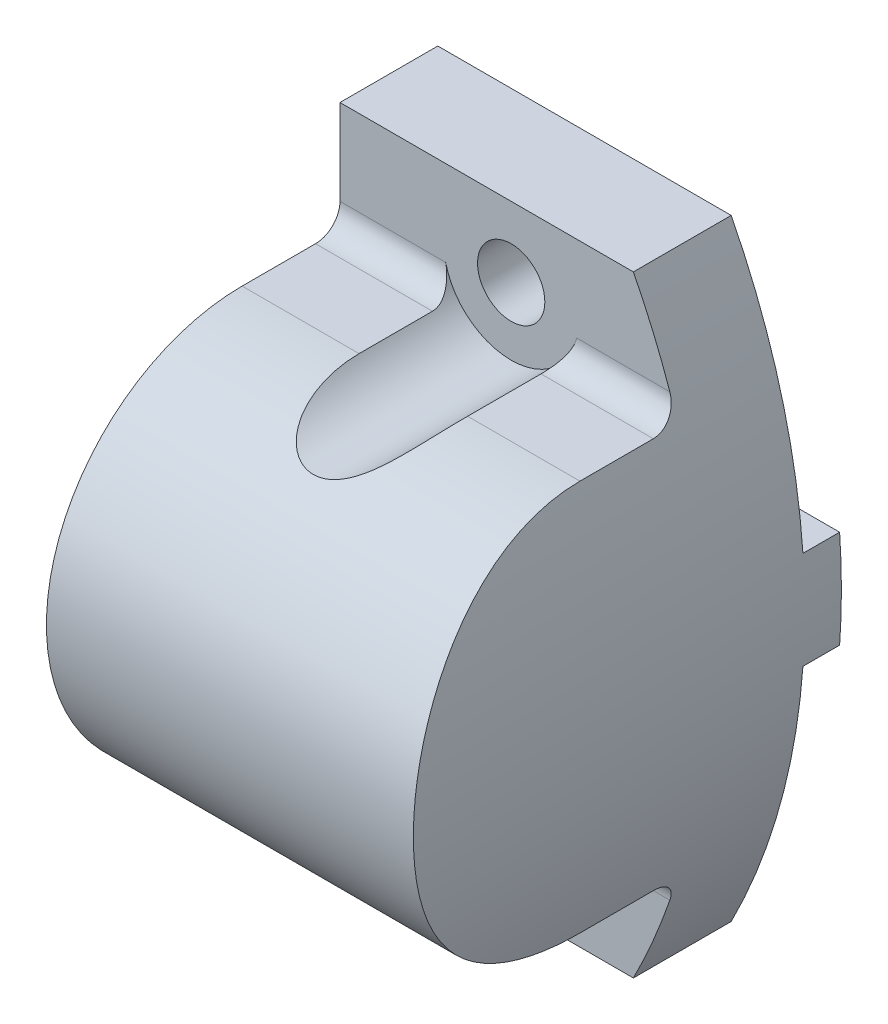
ISO-10303-21;
HEADER;
FILE_DESCRIPTION(('STEP AP214'),'2;1');
FILE_NAME('part.step','',(''),(''),'','','');
FILE_SCHEMA(('AUTOMOTIVE_DESIGN { 1 0 10303 214 1 1 1 1 }'));
ENDSEC;
DATA;
#1=APPLICATION_CONTEXT('core data for automotive mechanical design processes');
#2=APPLICATION_PROTOCOL_DEFINITION('international standard','automotive_design',2000,#1);
#3=PRODUCT_CONTEXT('',#1,'mechanical');
#4=PRODUCT('Part','Part','',(#3));
#5=PRODUCT_RELATED_PRODUCT_CATEGORY('part','',(#4));
#6=PRODUCT_DEFINITION_FORMATION('','',#4);
#7=PRODUCT_DEFINITION_CONTEXT('part definition',#1,'design');
#8=PRODUCT_DEFINITION('design','',#6,#7);
#9=PRODUCT_DEFINITION_SHAPE('','',#8);
#10=(LENGTH_UNIT() NAMED_UNIT(*) SI_UNIT(.MILLI.,.METRE.));
#11=(NAMED_UNIT(*) PLANE_ANGLE_UNIT() SI_UNIT($,.RADIAN.));
#12=(NAMED_UNIT(*) SI_UNIT($,.STERADIAN.) SOLID_ANGLE_UNIT());
#13=UNCERTAINTY_MEASURE_WITH_UNIT(LENGTH_MEASURE(1.E-05),#10,'distance_accuracy_value','');
#14=(GEOMETRIC_REPRESENTATION_CONTEXT(3) GLOBAL_UNCERTAINTY_ASSIGNED_CONTEXT((#13)) GLOBAL_UNIT_ASSIGNED_CONTEXT((#10,
#11,#12)) REPRESENTATION_CONTEXT('',''));
#15=CARTESIAN_POINT('',(0.,0.,0.));
#16=DIRECTION('',(0.,0.,1.));
#17=DIRECTION('',(1.,0.,0.));
#18=AXIS2_PLACEMENT_3D('',#15,#16,#17);
#19=CARTESIAN_POINT('',(55.,0.,16.));
#20=DIRECTION('',(-1.,0.,0.));
#21=DIRECTION('',(0.,-1.,0.));
#22=AXIS2_PLACEMENT_3D('',#19,#20,#21);
#23=CYLINDRICAL_SURFACE('',#22,16.);
#24=CARTESIAN_POINT('',(40.0766376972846,-13.856406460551,8.));
#25=CARTESIAN_POINT('',(40.1709949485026,-13.8752286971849,8.03260460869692));
#26=CARTESIAN_POINT('',(40.2634252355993,-13.8962657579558,8.06930360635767));
#27=CARTESIAN_POINT('',(40.4438308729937,-13.942085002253,8.15013154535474));
#28=CARTESIAN_POINT('',(40.5318132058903,-13.9668610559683,8.19424833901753));
#29=CARTESIAN_POINT('',(40.7020950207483,-14.0192510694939,8.28874393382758));
#30=CARTESIAN_POINT('',(40.7844461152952,-14.0468310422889,8.33904900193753));
#31=CARTESIAN_POINT('',(40.9443119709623,-14.1044316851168,8.44561640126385));
#32=CARTESIAN_POINT('',(41.0218242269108,-14.1344536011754,8.50188177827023));
#33=CARTESIAN_POINT('',(41.2934677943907,-14.2464778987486,8.71522430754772));
#34=CARTESIAN_POINT('',(41.4732908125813,-14.3339637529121,8.88806996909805));
#35=CARTESIAN_POINT('',(41.7187134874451,-14.4680156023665,9.16717845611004));
#36=CARTESIAN_POINT('',(41.7966664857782,-14.5133105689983,9.2638421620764));
#37=CARTESIAN_POINT('',(41.9448987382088,-14.6040230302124,9.46284310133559));
#38=CARTESIAN_POINT('',(42.0151799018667,-14.6494404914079,9.56517891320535));
#39=CARTESIAN_POINT('',(42.1846677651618,-14.7640961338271,9.83134348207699));
#40=CARTESIAN_POINT('',(42.2789477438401,-14.8329255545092,9.99848245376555));
#41=CARTESIAN_POINT('',(42.4525008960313,-14.9672124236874,10.3416815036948));
#42=CARTESIAN_POINT('',(42.5317660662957,-15.0326680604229,10.5177462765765));
#43=CARTESIAN_POINT('',(42.6771966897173,-15.1588509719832,10.8769636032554));
#44=CARTESIAN_POINT('',(42.7433526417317,-15.2195747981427,11.0601211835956));
#45=CARTESIAN_POINT('',(42.864195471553,-15.3352875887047,11.4319671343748));
#46=CARTESIAN_POINT('',(42.9188786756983,-15.3902747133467,11.6206572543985));
#47=CARTESIAN_POINT('',(43.0458981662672,-15.5226315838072,12.1086566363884));
#48=CARTESIAN_POINT('',(43.1111182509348,-15.5954235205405,12.4110776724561));
#49=CARTESIAN_POINT('',(43.2216956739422,-15.7237539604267,13.0231685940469));
#50=CARTESIAN_POINT('',(43.267042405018,-15.7792832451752,13.3328422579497));
#51=CARTESIAN_POINT('',(43.3409777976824,-15.8722141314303,13.9573048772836));
#52=CARTESIAN_POINT('',(43.3695424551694,-15.9095897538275,14.272100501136));
#53=CARTESIAN_POINT('',(43.4117874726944,-15.9655898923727,14.9042630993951));
#54=CARTESIAN_POINT('',(43.4254704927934,-15.9842177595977,15.2216296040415));
#55=CARTESIAN_POINT('',(43.439154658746,-16.0028396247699,15.8682703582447));
#56=CARTESIAN_POINT('',(43.4386628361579,-16.0021622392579,16.1975744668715));
#57=CARTESIAN_POINT('',(43.4227421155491,-15.9805145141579,16.8552254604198));
#58=CARTESIAN_POINT('',(43.4073103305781,-15.9595402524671,17.1835721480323));
#59=CARTESIAN_POINT('',(43.3603826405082,-15.8976019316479,17.8367741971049));
#60=CARTESIAN_POINT('',(43.3289088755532,-15.8566654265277,18.161633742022));
#61=CARTESIAN_POINT('',(43.2475986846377,-15.7554090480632,18.8059358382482));
#62=CARTESIAN_POINT('',(43.1977706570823,-15.6950980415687,19.1253807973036));
#63=CARTESIAN_POINT('',(43.0982907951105,-15.5815675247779,19.641003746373));
#64=CARTESIAN_POINT('',(43.0551967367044,-15.5337779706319,19.839665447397));
#65=CARTESIAN_POINT('',(42.9588641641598,-15.4313147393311,20.2326968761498));
#66=CARTESIAN_POINT('',(42.9056279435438,-15.3766426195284,20.4270675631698));
#67=CARTESIAN_POINT('',(42.7875736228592,-15.261128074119,20.8101943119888));
#68=CARTESIAN_POINT('',(42.7227663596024,-15.2002914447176,20.9989554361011));
#69=CARTESIAN_POINT('',(42.579791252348,-15.0733696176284,21.3695278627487));
#70=CARTESIAN_POINT('',(42.5016279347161,-15.0072862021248,21.5513414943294));
#71=CARTESIAN_POINT('',(42.3557729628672,-14.891716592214,21.8527307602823));
#72=CARTESIAN_POINT('',(42.2919987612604,-14.8432140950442,21.9745833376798));
#73=CARTESIAN_POINT('',(42.1562257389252,-14.7449734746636,22.213080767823));
#74=CARTESIAN_POINT('',(42.0842292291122,-14.6952357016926,22.3297270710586));
#75=CARTESIAN_POINT('',(41.9313414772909,-14.595371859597,22.5567118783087));
#76=CARTESIAN_POINT('',(41.8504593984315,-14.5452462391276,22.667056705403));
#77=CARTESIAN_POINT('',(41.6791138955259,-14.4456097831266,22.8802776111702));
#78=CARTESIAN_POINT('',(41.588653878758,-14.3960987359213,22.9831563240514));
#79=CARTESIAN_POINT('',(41.3555995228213,-14.2775806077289,23.22326359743));
#80=CARTESIAN_POINT('',(41.2075339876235,-14.2095409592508,23.3557813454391));
#81=CARTESIAN_POINT('',(40.8898384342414,-14.0820537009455,23.5970000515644));
#82=CARTESIAN_POINT('',(40.7202373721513,-14.0225947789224,23.7057324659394));
#83=CARTESIAN_POINT('',(40.3929451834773,-13.9270880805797,23.8768078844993));
#84=CARTESIAN_POINT('',(40.2384501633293,-13.888759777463,23.9439538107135));
#85=CARTESIAN_POINT('',(39.9186893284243,-13.8248251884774,24.0547088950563));
#86=CARTESIAN_POINT('',(39.753429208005,-13.7992122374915,24.0983303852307));
#87=CARTESIAN_POINT('',(39.415636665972,-13.7630875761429,24.159579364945));
#88=CARTESIAN_POINT('',(39.2430729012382,-13.7526496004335,24.1770799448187));
#89=CARTESIAN_POINT('',(38.8971470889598,-13.7482441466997,24.1844860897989));
#90=CARTESIAN_POINT('',(38.7237851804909,-13.7542739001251,24.1743962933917));
#91=CARTESIAN_POINT('',(38.3958592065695,-13.7810030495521,24.1292394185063));
#92=CARTESIAN_POINT('',(38.2409015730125,-13.8004889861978,24.0962373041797));
#93=CARTESIAN_POINT('',(37.9390428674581,-13.8511287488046,24.0092908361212));
#94=CARTESIAN_POINT('',(37.7921428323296,-13.8822840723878,23.9553437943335));
#95=CARTESIAN_POINT('',(37.5000909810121,-13.9561920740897,23.8250004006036));
#96=CARTESIAN_POINT('',(37.3556373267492,-13.9995536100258,23.7474000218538));
#97=CARTESIAN_POINT('',(37.0804116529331,-14.0938017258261,23.5745902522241));
#98=CARTESIAN_POINT('',(36.9496469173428,-14.144692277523,23.4793715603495));
#99=CARTESIAN_POINT('',(36.7267971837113,-14.2405872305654,23.294809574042));
#100=CARTESIAN_POINT('',(36.6321826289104,-14.2847592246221,23.2080420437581));
#101=CARTESIAN_POINT('',(36.4517777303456,-14.3748874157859,23.0265866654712));
#102=CARTESIAN_POINT('',(36.3659916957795,-14.4208444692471,22.9318949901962));
#103=CARTESIAN_POINT('',(36.1210090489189,-14.5599220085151,22.6374335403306));
#104=CARTESIAN_POINT('',(35.9744814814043,-14.6541149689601,22.4275296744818));
#105=CARTESIAN_POINT('',(35.7403851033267,-14.8182385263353,22.0377424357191));
#106=CARTESIAN_POINT('',(35.6469498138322,-14.8889105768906,21.8615487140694));
#107=CARTESIAN_POINT('',(35.4756040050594,-15.0261762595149,21.5001227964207));
#108=CARTESIAN_POINT('',(35.3977022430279,-15.0927675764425,21.3148855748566));
#109=CARTESIAN_POINT('',(35.2553685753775,-15.220497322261,20.9372347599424));
#110=CARTESIAN_POINT('',(35.1909553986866,-15.2816281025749,20.7448116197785));
#111=CARTESIAN_POINT('',(35.0739039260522,-15.3974001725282,20.3544863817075));
#112=CARTESIAN_POINT('',(35.0212691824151,-15.4520395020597,20.1565826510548));
#113=CARTESIAN_POINT('',(34.9007630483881,-15.5815088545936,19.6492510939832));
#114=CARTESIAN_POINT('',(34.8398488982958,-15.6514612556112,19.336908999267));
#115=CARTESIAN_POINT('',(34.7378428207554,-15.7728957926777,18.7054236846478));
#116=CARTESIAN_POINT('',(34.6967610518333,-15.8243684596,18.3862770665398));
#117=CARTESIAN_POINT('',(34.6314545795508,-15.9080502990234,17.7433233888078));
#118=CARTESIAN_POINT('',(34.6072537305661,-15.9402322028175,17.4195103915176));
#119=CARTESIAN_POINT('',(34.5740381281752,-15.9847859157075,16.7698315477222));
#120=CARTESIAN_POINT('',(34.5650206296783,-15.9971613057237,16.443966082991));
#121=CARTESIAN_POINT('',(34.5614446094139,-16.0020401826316,15.7823033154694));
#122=CARTESIAN_POINT('',(34.5673243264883,-15.9939413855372,15.4464990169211));
#123=CARTESIAN_POINT('',(34.5949306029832,-15.9566874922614,14.7766176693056));
#124=CARTESIAN_POINT('',(34.616660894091,-15.9275274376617,14.4425410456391));
#125=CARTESIAN_POINT('',(34.6776021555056,-15.8486236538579,13.7790701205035));
#126=CARTESIAN_POINT('',(34.7167795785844,-15.798919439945,13.4496680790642));
#127=CARTESIAN_POINT('',(34.8155819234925,-15.6797489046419,12.7976421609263));
#128=CARTESIAN_POINT('',(34.8751945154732,-15.6102945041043,12.475014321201));
#129=CARTESIAN_POINT('',(34.9886393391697,-15.4866683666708,11.975271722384));
#130=CARTESIAN_POINT('',(35.034116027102,-15.4385902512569,11.7947168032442));
#131=CARTESIAN_POINT('',(35.1344012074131,-15.3369112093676,11.4378143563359));
#132=CARTESIAN_POINT('',(35.1892074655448,-15.2833116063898,11.2614658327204));
#133=CARTESIAN_POINT('',(35.3093805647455,-15.171266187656,10.9141414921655));
#134=CARTESIAN_POINT('',(35.3747384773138,-15.1128244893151,10.7431612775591));
#135=CARTESIAN_POINT('',(35.5175051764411,-14.9919506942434,10.4077599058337));
#136=CARTESIAN_POINT('',(35.5949106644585,-14.9295196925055,10.2433369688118));
#137=CARTESIAN_POINT('',(35.741314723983,-14.8186300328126,9.96473314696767));
#138=CARTESIAN_POINT('',(35.8072066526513,-14.7707937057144,9.84867083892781));
#139=CARTESIAN_POINT('',(35.9470974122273,-14.6743025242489,9.6219114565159));
#140=CARTESIAN_POINT('',(36.0210939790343,-14.625647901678,9.51121289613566));
#141=CARTESIAN_POINT('',(36.1778312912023,-14.5283619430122,9.29622442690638));
#142=CARTESIAN_POINT('',(36.260567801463,-14.4797306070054,9.19193145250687));
#143=CARTESIAN_POINT('',(36.435342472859,-14.3835359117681,8.99098325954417));
#144=CARTESIAN_POINT('',(36.5273769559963,-14.3359721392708,8.8943250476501));
#145=CARTESIAN_POINT('',(36.7650940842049,-14.2221190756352,8.66830860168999));
#146=CARTESIAN_POINT('',(36.9162191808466,-14.1570861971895,8.543924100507));
#147=CARTESIAN_POINT('',(37.2388661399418,-14.0367684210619,8.31980946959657));
#148=CARTESIAN_POINT('',(37.4103147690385,-13.9814502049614,8.21999458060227));
#149=CARTESIAN_POINT('',(37.6445373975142,-13.9193474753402,8.10996709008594));
#150=CARTESIAN_POINT('',(37.6992564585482,-13.9057211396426,8.08598700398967));
#151=CARTESIAN_POINT('',(37.8102043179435,-13.8799326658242,8.04084561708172));
#152=CARTESIAN_POINT('',(37.8664336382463,-13.8677710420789,8.01968530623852));
#153=CARTESIAN_POINT('',(37.9233623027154,-13.856406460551,8.00000000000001));
#154=B_SPLINE_CURVE_WITH_KNOTS('',3,(#24,#25,#26,#27,#28,#29,#30,#31,#32,#33,#34,#35,#36,#37,
#38,#39,#40,#41,#42,#43,#44,#45,#46,#47,#48,#49,#50,#51,#52,#53,#54,#55,#56,#57,#58,#59,#60,#61,
#62,#63,#64,#65,#66,#67,#68,#69,#70,#71,#72,#73,#74,#75,#76,#77,#78,#79,#80,#81,#82,#83,#84,#85,
#86,#87,#88,#89,#90,#91,#92,#93,#94,#95,#96,#97,#98,#99,#100,#101,#102,#103,#104,#105,#106,#107,
#108,#109,#110,#111,#112,#113,#114,#115,#116,#117,#118,#119,#120,#121,#122,#123,#124,#125,#126,
#127,#128,#129,#130,#131,#132,#133,#134,#135,#136,#137,#138,#139,#140,#141,#142,#143,#144,#145,
#146,#147,#148,#149,#150,#151,#152,#153),.UNSPECIFIED.,.F.,.F.,(4,2,2,2,2,2,2,2,2,2,2,2,2,2,2,2,
2,2,2,2,2,2,2,2,2,2,2,2,2,2,2,2,2,2,2,2,2,2,2,2,2,2,2,2,2,2,2,2,2,2,2,2,2,2,2,2,2,2,2,2,2,2,2,2,
4),(0.,0.304551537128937,0.608609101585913,0.909342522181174,1.21023036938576,1.99812671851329,
2.3944658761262,2.79070615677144,3.40135845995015,4.01233534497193,4.623753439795,
5.23536701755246,6.1874168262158,7.13997416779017,8.09389069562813,9.04763668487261,
10.0345905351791,11.0217351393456,12.007521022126,12.9928563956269,13.6189870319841,
14.2449762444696,14.8703822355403,15.4955766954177,15.9327971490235,16.369895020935,
16.8065462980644,17.243042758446,17.8708762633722,18.4978743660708,19.0140146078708,
19.5298840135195,20.0482517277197,20.5665322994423,21.0433074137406,21.5201437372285,
22.0271377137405,22.5344001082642,22.9411267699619,23.3480510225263,24.1631134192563,
24.7971120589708,25.4314671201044,26.0666972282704,26.7021186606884,27.6781619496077,
28.6547046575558,29.6326245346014,30.6103675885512,31.6172052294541,32.6242799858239,
33.6294266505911,34.6339679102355,35.2105807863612,35.7870557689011,36.3630454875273,
36.9388777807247,37.3639166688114,37.788837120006,38.2135526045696,38.6381007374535,
39.2545949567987,39.8689316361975,40.052684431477,40.2365015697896),.UNSPECIFIED.);
#155=CARTESIAN_POINT('',(43.4370598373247,-16.,16.));
#156=VERTEX_POINT('',#155);
#157=CARTESIAN_POINT('',(34.5629401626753,-16.,16.));
#158=VERTEX_POINT('',#157);
#159=EDGE_CURVE('E230',#156,#158,#154,.T.);
#160=ORIENTED_EDGE('',*,*,#159,.F.);
#161=DIRECTION('',(-1.,0.,0.));
#162=VECTOR('',#161,1.);
#163=CARTESIAN_POINT('',(55.,-16.,16.));
#164=LINE('',#163,#162);
#165=CARTESIAN_POINT('',(52.6212884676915,-16.,16.));
#166=VERTEX_POINT('',#165);
#167=EDGE_CURVE('E207',#166,#156,#164,.T.);
#168=ORIENTED_EDGE('',*,*,#167,.F.);
#169=CARTESIAN_POINT('',(52.6212884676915,16.,16.));
#170=CARTESIAN_POINT('',(52.621286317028,16.0000003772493,16.2199025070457));
#171=CARTESIAN_POINT('',(52.6226674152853,15.9954657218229,16.4397770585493));
#172=CARTESIAN_POINT('',(52.6281732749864,15.9773435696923,16.8791111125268));
#173=CARTESIAN_POINT('',(52.6322979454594,15.9637563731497,17.0985706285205));
#174=CARTESIAN_POINT('',(52.6487485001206,15.9094568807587,17.755621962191));
#175=CARTESIAN_POINT('',(52.6651509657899,15.8552066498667,18.192075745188));
#176=CARTESIAN_POINT('',(52.7082672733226,15.7112744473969,19.057426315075));
#177=CARTESIAN_POINT('',(52.7349560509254,15.6216785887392,19.486338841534));
#178=CARTESIAN_POINT('',(52.7978318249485,15.4078345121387,20.3347427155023));
#179=CARTESIAN_POINT('',(52.8340190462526,15.283585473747,20.7542338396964));
#180=CARTESIAN_POINT('',(52.9147965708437,15.0015263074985,21.580755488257));
#181=CARTESIAN_POINT('',(52.9593838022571,14.8437284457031,21.9877905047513));
#182=CARTESIAN_POINT('',(53.0556776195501,14.4957799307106,22.7869207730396));
#183=CARTESIAN_POINT('',(53.1073844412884,14.305628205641,23.1790155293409));
#184=CARTESIAN_POINT('',(53.2164795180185,13.8943000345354,23.945932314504));
#185=CARTESIAN_POINT('',(53.2738698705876,13.6731121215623,24.3207478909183));
#186=CARTESIAN_POINT('',(53.3927434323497,13.2012921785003,25.0506767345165));
#187=CARTESIAN_POINT('',(53.4542267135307,12.950659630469,25.4057896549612));
#188=CARTESIAN_POINT('',(53.5813233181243,12.4144952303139,26.1034146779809));
#189=CARTESIAN_POINT('',(53.6470031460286,12.1282086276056,26.4453348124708));
#190=CARTESIAN_POINT('',(53.7791334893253,11.5281893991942,27.1040232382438));
#191=CARTESIAN_POINT('',(53.845584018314,11.2144562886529,27.420791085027));
#192=CARTESIAN_POINT('',(53.9774583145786,10.5614832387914,28.0272036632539));
#193=CARTESIAN_POINT('',(54.0428819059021,10.2222389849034,28.3168437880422));
#194=CARTESIAN_POINT('',(54.1709211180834,9.52042636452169,28.8670233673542));
#195=CARTESIAN_POINT('',(54.2335367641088,9.1578582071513,29.1275630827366));
#196=CARTESIAN_POINT('',(54.3554394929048,8.40443913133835,29.6224983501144));
#197=CARTESIAN_POINT('',(54.414638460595,8.01317604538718,29.8562888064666));
#198=CARTESIAN_POINT('',(54.5266854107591,7.21140779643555,30.289972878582));
#199=CARTESIAN_POINT('',(54.5795332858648,6.80090230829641,30.4898659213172));
#200=CARTESIAN_POINT('',(54.6773554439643,5.96359006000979,30.8540897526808));
#201=CARTESIAN_POINT('',(54.7223313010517,5.53678657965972,31.0184276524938));
#202=CARTESIAN_POINT('',(54.8031162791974,4.66989419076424,31.3101672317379));
#203=CARTESIAN_POINT('',(54.8389256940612,4.2298057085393,31.4375700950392));
#204=CARTESIAN_POINT('',(54.8994970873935,3.35166578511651,31.6513578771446));
#205=CARTESIAN_POINT('',(54.9245311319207,2.91387990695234,31.7387569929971));
#206=CARTESIAN_POINT('',(54.9642196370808,2.03207343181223,31.8767067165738));
#207=CARTESIAN_POINT('',(54.9788742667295,1.58805293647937,31.9272579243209));
#208=CARTESIAN_POINT('',(54.9973854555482,0.697181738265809,31.991039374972));
#209=CARTESIAN_POINT('',(55.0012436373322,0.250331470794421,32.0042752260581));
#210=CARTESIAN_POINT('',(54.9980559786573,-0.642866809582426,31.9933171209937));
#211=CARTESIAN_POINT('',(54.9910103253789,-1.08921483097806,31.9691238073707));
#212=CARTESIAN_POINT('',(54.9665903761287,-1.96467183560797,31.8848234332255));
#213=CARTESIAN_POINT('',(54.9495324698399,-2.39389610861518,31.825816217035));
#214=CARTESIAN_POINT('',(54.9058058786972,-3.2456638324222,31.6733165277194));
#215=CARTESIAN_POINT('',(54.8791374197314,-3.66820744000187,31.5798248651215));
#216=CARTESIAN_POINT('',(54.8168944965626,-4.50373124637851,31.3591379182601));
#217=CARTESIAN_POINT('',(54.7813198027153,-4.9167111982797,31.2319417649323));
#218=CARTESIAN_POINT('',(54.7021941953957,-5.73036176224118,30.9448678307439));
#219=CARTESIAN_POINT('',(54.6586431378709,-6.13103215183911,30.7849894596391));
#220=CARTESIAN_POINT('',(54.5641616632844,-6.9218959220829,30.4318052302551));
#221=CARTESIAN_POINT('',(54.5131541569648,-7.31192199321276,30.2381454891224));
#222=CARTESIAN_POINT('',(54.4054581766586,-8.0743019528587,29.8200816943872));
#223=CARTESIAN_POINT('',(54.3487696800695,-8.44665577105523,29.5956775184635));
#224=CARTESIAN_POINT('',(54.231160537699,-9.17148130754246,29.1176383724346));
#225=CARTESIAN_POINT('',(54.1702391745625,-9.5239496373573,28.8639984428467));
#226=CARTESIAN_POINT('',(54.0457307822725,-10.2068345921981,28.3291782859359));
#227=CARTESIAN_POINT('',(53.9821436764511,-10.5372505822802,28.0479972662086));
#228=CARTESIAN_POINT('',(53.8516035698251,-11.1856197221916,27.4491759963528));
#229=CARTESIAN_POINT('',(53.7846121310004,-11.5026863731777,27.1305833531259));
#230=CARTESIAN_POINT('',(53.6513664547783,-12.1089739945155,26.4677845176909));
#231=CARTESIAN_POINT('',(53.5851122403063,-12.3981941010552,26.1235775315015));
#232=CARTESIAN_POINT('',(53.4551710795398,-12.9469779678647,25.4115767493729));
#233=CARTESIAN_POINT('',(53.3914849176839,-13.206532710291,25.0437758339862));
#234=CARTESIAN_POINT('',(53.2992902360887,-13.5720835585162,24.4763910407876));
#235=CARTESIAN_POINT('',(53.2691137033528,-13.6899730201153,24.2846437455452));
#236=CARTESIAN_POINT('',(53.2100755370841,-13.9176755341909,23.8961393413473));
#237=CARTESIAN_POINT('',(53.1812142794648,-14.0274862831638,23.6993808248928));
#238=CARTESIAN_POINT('',(53.0964391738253,-14.346318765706,23.0985828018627));
#239=CARTESIAN_POINT('',(53.042881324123,-14.5425929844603,22.6873509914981));
#240=CARTESIAN_POINT('',(52.9437015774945,-14.8996257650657,21.848826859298));
#241=CARTESIAN_POINT('',(52.8980793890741,-15.0603856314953,21.42153512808));
#242=CARTESIAN_POINT('',(52.8367080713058,-15.2737586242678,20.7711973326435));
#243=CARTESIAN_POINT('',(52.8174348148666,-15.3402322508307,20.5529484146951));
#244=CARTESIAN_POINT('',(52.7813832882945,-15.4638196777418,20.1136763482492));
#245=CARTESIAN_POINT('',(52.7646043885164,-15.5209358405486,19.8926539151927));
#246=CARTESIAN_POINT('',(52.7182285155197,-15.678023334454,19.2261139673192));
#247=CARTESIAN_POINT('',(52.6925683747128,-15.7638162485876,18.7768721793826));
#248=CARTESIAN_POINT('',(52.6556293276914,-15.8867335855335,17.9398363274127));
#249=CARTESIAN_POINT('',(52.6427755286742,-15.9292109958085,17.5528792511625));
#250=CARTESIAN_POINT('',(52.6255945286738,-15.9858366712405,16.7772993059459));
#251=CARTESIAN_POINT('',(52.6212544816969,-16.0000276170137,16.3886798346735));
#252=CARTESIAN_POINT('',(52.6212884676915,-16.,16.));
#253=B_SPLINE_CURVE_WITH_KNOTS('',3,(#169,#170,#171,#172,#173,#174,#175,#176,#177,#178,#179,
#180,#181,#182,#183,#184,#185,#186,#187,#188,#189,#190,#191,#192,#193,#194,#195,#196,#197,#198,
#199,#200,#201,#202,#203,#204,#205,#206,#207,#208,#209,#210,#211,#212,#213,#214,#215,#216,#217,
#218,#219,#220,#221,#222,#223,#224,#225,#226,#227,#228,#229,#230,#231,#232,#233,#234,#235,#236,
#237,#238,#239,#240,#241,#242,#243,#244,#245,#246,#247,#248,#249,#250,#251,#252),.UNSPECIFIED.,
.F.,.F.,(4,2,2,2,2,2,2,2,2,2,2,2,2,2,2,2,2,2,2,2,2,2,2,2,2,2,2,2,2,2,2,2,2,2,2,2,2,2,2,2,2,4),
(0.,0.659600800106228,1.31917973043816,2.63777195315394,3.95317132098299,5.26860183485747,
6.58355222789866,7.89854619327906,9.21402729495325,10.5295315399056,11.880258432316,
13.2310091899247,14.5819889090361,15.9329565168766,17.3101270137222,18.6873207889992,
20.0642388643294,21.4411128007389,22.7808277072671,24.1205207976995,25.4600125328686,
26.7994812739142,28.0987423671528,29.3979729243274,30.6972369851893,31.9965245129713,
33.3103444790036,34.6241696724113,35.9382180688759,37.2523042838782,38.6140453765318,
39.9758286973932,41.3380248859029,42.019157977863,42.7004845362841,44.075098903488,
45.4496627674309,46.1363471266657,46.8228578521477,48.1950843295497,49.3624881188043,
50.5281291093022),.UNSPECIFIED.);
#254=CARTESIAN_POINT('',(52.6212884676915,16.,16.));
#255=VERTEX_POINT('',#254);
#256=EDGE_CURVE('E211',#255,#166,#253,.T.);
#257=ORIENTED_EDGE('',*,*,#256,.F.);
#258=DIRECTION('',(-1.,0.,0.));
#259=VECTOR('',#258,1.);
#260=CARTESIAN_POINT('',(55.,16.,16.));
#261=LINE('',#260,#259);
#262=CARTESIAN_POINT('',(43.4370598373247,16.,16.));
#263=VERTEX_POINT('',#262);
#264=EDGE_CURVE('E216',#255,#263,#261,.T.);
#265=ORIENTED_EDGE('',*,*,#264,.T.);
#266=CARTESIAN_POINT('',(34.5629401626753,16.,16.));
#267=CARTESIAN_POINT('',(34.5629559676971,16.0000035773,16.1743936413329));
#268=CARTESIAN_POINT('',(34.5650292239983,15.9971488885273,16.3487895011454));
#269=CARTESIAN_POINT('',(34.5734040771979,15.985747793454,16.6973079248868));
#270=CARTESIAN_POINT('',(34.5797060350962,15.9772009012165,16.8714304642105));
#271=CARTESIAN_POINT('',(34.5966721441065,15.9544128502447,17.2195127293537));
#272=CARTESIAN_POINT('',(34.6073467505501,15.9401580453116,17.3934710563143));
#273=CARTESIAN_POINT('',(34.6332870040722,15.9060082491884,17.7404868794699));
#274=CARTESIAN_POINT('',(34.6485525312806,15.8861134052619,17.9135443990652));
#275=CARTESIAN_POINT('',(34.6841914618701,15.8405068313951,18.2603712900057));
#276=CARTESIAN_POINT('',(34.7046204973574,15.8147320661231,18.434126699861));
#277=CARTESIAN_POINT('',(34.7509305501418,15.7576137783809,18.7799866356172));
#278=CARTESIAN_POINT('',(34.7768113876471,15.7262704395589,18.9520912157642));
#279=CARTESIAN_POINT('',(34.8345381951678,15.6582152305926,19.2940323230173));
#280=CARTESIAN_POINT('',(34.8663776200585,15.6215092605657,19.4638711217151));
#281=CARTESIAN_POINT('',(34.9366951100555,15.5429346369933,19.8009369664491));
#282=CARTESIAN_POINT('',(34.975172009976,15.5010668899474,19.9681644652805));
#283=CARTESIAN_POINT('',(35.0605042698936,15.4114730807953,20.3031647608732));
#284=CARTESIAN_POINT('',(35.1075285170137,15.3636364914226,20.4708653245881));
#285=CARTESIAN_POINT('',(35.2103301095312,15.263326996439,20.8021658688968));
#286=CARTESIAN_POINT('',(35.2661073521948,15.210854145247,20.9657658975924));
#287=CARTESIAN_POINT('',(35.3873830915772,15.102034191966,21.2874677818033));
#288=CARTESIAN_POINT('',(35.4528548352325,15.045697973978,21.4455833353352));
#289=CARTESIAN_POINT('',(35.5948829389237,14.9298636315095,21.755564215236));
#290=CARTESIAN_POINT('',(35.6714367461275,14.8703662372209,21.9074309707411));
#291=CARTESIAN_POINT('',(35.8179458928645,14.7632690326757,22.1693649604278));
#292=CARTESIAN_POINT('',(35.8853713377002,14.7160790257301,22.281014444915));
#293=CARTESIAN_POINT('',(36.0282181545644,14.6211917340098,22.4988347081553));
#294=CARTESIAN_POINT('',(36.1036373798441,14.5734945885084,22.605006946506));
#295=CARTESIAN_POINT('',(36.263012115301,14.4784705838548,22.8107792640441));
#296=CARTESIAN_POINT('',(36.3469593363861,14.4311434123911,22.9103855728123));
#297=CARTESIAN_POINT('',(36.5238930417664,14.3378831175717,23.1018630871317));
#298=CARTESIAN_POINT('',(36.6168760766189,14.2919494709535,23.193737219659));
#299=CARTESIAN_POINT('',(36.8540769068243,14.1835885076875,23.4057644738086));
#300=CARTESIAN_POINT('',(37.0032099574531,14.1225002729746,23.5212263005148));
#301=CARTESIAN_POINT('',(37.3203306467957,14.0100677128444,23.7286464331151));
#302=CARTESIAN_POINT('',(37.4882959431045,13.9587120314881,23.8206321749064));
#303=CARTESIAN_POINT('',(37.8139611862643,13.8771921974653,23.9642530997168));
#304=CARTESIAN_POINT('',(37.9693755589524,13.8449982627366,24.0198856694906));
#305=CARTESIAN_POINT('',(38.2888172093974,13.7937813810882,24.1076640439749));
#306=CARTESIAN_POINT('',(38.4528401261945,13.7747518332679,24.1398216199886));
#307=CARTESIAN_POINT('',(38.785520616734,13.7516477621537,24.1787973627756));
#308=CARTESIAN_POINT('',(38.9541919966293,13.7476240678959,24.1855294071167));
#309=CARTESIAN_POINT('',(39.2902057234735,13.7550912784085,24.1729744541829));
#310=CARTESIAN_POINT('',(39.457548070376,13.7665821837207,24.1536874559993));
#311=CARTESIAN_POINT('',(39.7767863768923,13.8028874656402,24.0920613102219));
#312=CARTESIAN_POINT('',(39.9290275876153,13.8269440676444,24.0510315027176));
#313=CARTESIAN_POINT('',(40.2243507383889,13.8858893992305,23.9489329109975));
#314=CARTESIAN_POINT('',(40.3674295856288,13.9207817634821,23.8878574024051));
#315=CARTESIAN_POINT('',(40.6904118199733,14.0126625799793,23.7237867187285));
#316=CARTESIAN_POINT('',(40.8656746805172,14.073110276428,23.6136014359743));
#317=CARTESIAN_POINT('',(41.1935903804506,14.2032715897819,23.3679281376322));
#318=CARTESIAN_POINT('',(41.346201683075,14.2730017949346,23.2323946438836));
#319=CARTESIAN_POINT('',(41.5889943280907,14.3961348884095,22.9831829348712));
#320=CARTESIAN_POINT('',(41.6846105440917,14.4485638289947,22.8741980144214));
#321=CARTESIAN_POINT('',(41.8651491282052,14.5540592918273,22.6479265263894));
#322=CARTESIAN_POINT('',(41.9500668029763,14.6071260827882,22.530636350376));
#323=CARTESIAN_POINT('',(42.1100540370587,14.7127358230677,22.2891022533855));
#324=CARTESIAN_POINT('',(42.1851107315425,14.7652780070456,22.1648495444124));
#325=CARTESIAN_POINT('',(42.3261413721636,14.8688550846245,21.9106693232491));
#326=CARTESIAN_POINT('',(42.3921122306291,14.9198894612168,21.7807399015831));
#327=CARTESIAN_POINT('',(42.5525632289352,15.0493572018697,21.4376035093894));
#328=CARTESIAN_POINT('',(42.6407052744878,15.1260616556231,21.2207673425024));
#329=CARTESIAN_POINT('',(42.7992625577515,15.2716622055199,20.7781518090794));
#330=CARTESIAN_POINT('',(42.8696668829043,15.3405534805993,20.5523670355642));
#331=CARTESIAN_POINT('',(42.9955916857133,15.4693419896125,20.0934609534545));
#332=CARTESIAN_POINT('',(43.0510680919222,15.5292123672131,19.8603201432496));
#333=CARTESIAN_POINT('',(43.1490682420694,15.6388189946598,19.3890812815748));
#334=CARTESIAN_POINT('',(43.1915946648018,15.6885573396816,19.150984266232));
#335=CARTESIAN_POINT('',(43.2653173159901,15.7771950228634,18.6719384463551));
#336=CARTESIAN_POINT('',(43.2965521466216,15.8161311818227,18.4310023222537));
#337=CARTESIAN_POINT('',(43.3491785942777,15.8830350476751,17.9465381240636));
#338=CARTESIAN_POINT('',(43.3705692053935,15.9110016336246,17.7030097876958));
#339=CARTESIAN_POINT('',(43.4042330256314,15.955534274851,17.2165611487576));
#340=CARTESIAN_POINT('',(43.4165886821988,15.9722033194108,16.9736560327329));
#341=CARTESIAN_POINT('',(43.4288962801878,15.9888778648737,16.6087799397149));
#342=CARTESIAN_POINT('',(43.4319611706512,15.9930478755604,16.4870828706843));
#343=CARTESIAN_POINT('',(43.4360414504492,15.9986090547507,16.2435927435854));
#344=CARTESIAN_POINT('',(43.4370568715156,16.0000002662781,16.1217996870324));
#345=CARTESIAN_POINT('',(43.4370598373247,16.,16.));
#346=B_SPLINE_CURVE_WITH_KNOTS('',3,(#266,#267,#268,#269,#270,#271,#272,#273,#274,#275,#276,
#277,#278,#279,#280,#281,#282,#283,#284,#285,#286,#287,#288,#289,#290,#291,#292,#293,#294,#295,
#296,#297,#298,#299,#300,#301,#302,#303,#304,#305,#306,#307,#308,#309,#310,#311,#312,#313,#314,
#315,#316,#317,#318,#319,#320,#321,#322,#323,#324,#325,#326,#327,#328,#329,#330,#331,#332,#333,
#334,#335,#336,#337,#338,#339,#340,#341,#342,#343,#344,#345),.UNSPECIFIED.,.F.,.F.,(4,2,2,2,2,2,
2,2,2,2,2,2,2,2,2,2,2,2,2,2,2,2,2,2,2,2,2,2,2,2,2,2,2,2,2,2,2,2,2,4),(0.,0.523148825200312,
1.04634231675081,1.57079417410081,2.09523233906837,2.62558150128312,3.1559131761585,
3.68566569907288,4.21532532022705,4.75689038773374,5.29844909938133,5.83854025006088,
6.37850718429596,6.79432237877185,7.2100261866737,7.62532973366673,8.04047535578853,
8.63301304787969,9.22485505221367,9.7272431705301,10.2293791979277,10.7332145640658,
11.2370499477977,11.7135122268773,12.190134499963,12.8335892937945,13.4782098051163,
13.940125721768,14.4022435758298,14.8649584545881,15.3278301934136,16.0656079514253,
16.803838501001,17.5442251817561,18.2844586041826,19.0221369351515,19.759890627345,
20.4908250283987,20.8562041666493,21.2215776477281),.UNSPECIFIED.);
#347=CARTESIAN_POINT('',(34.5629401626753,16.,16.));
#348=VERTEX_POINT('',#347);
#349=EDGE_CURVE('E11',#348,#263,#346,.T.);
#350=ORIENTED_EDGE('',*,*,#349,.F.);
#351=CARTESIAN_POINT('',(25.,16.,16.));
#352=VERTEX_POINT('',#351);
#353=EDGE_CURVE('E353',#348,#352,#261,.T.);
#354=ORIENTED_EDGE('',*,*,#353,.T.);
#355=CARTESIAN_POINT('',(25.,0.,16.));
#356=DIRECTION('',(1.,0.,0.));
#357=DIRECTION('',(0.,-1.,0.));
#358=AXIS2_PLACEMENT_3D('',#355,#356,#357);
#359=CIRCLE('',#358,16.);
#360=CARTESIAN_POINT('',(25.,-16.,16.));
#361=VERTEX_POINT('',#360);
#362=EDGE_CURVE('E332',#352,#361,#359,.T.);
#363=ORIENTED_EDGE('',*,*,#362,.T.);
#364=EDGE_CURVE('E210',#158,#361,#164,.T.);
#365=ORIENTED_EDGE('',*,*,#364,.F.);
#366=EDGE_LOOP('',(#160,#168,#257,#265,#350,#354,#363,#365));
#367=FACE_BOUND('',#366,.T.);
#368=ADVANCED_FACE('F31',(#367),#23,.T.);
#369=CARTESIAN_POINT('',(55.,-18.,10.));
#370=DIRECTION('',(-1.,0.,0.));
#371=DIRECTION('',(0.,-1.,0.));
#372=AXIS2_PLACEMENT_3D('',#369,#370,#371);
#373=CYLINDRICAL_SURFACE('',#372,2.);
#374=CARTESIAN_POINT('',(44.3560713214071,-18.,8.));
#375=CARTESIAN_POINT('',(44.3425336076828,-17.9419529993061,7.99999370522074));
#376=CARTESIAN_POINT('',(44.3280383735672,-17.8841449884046,8.00252666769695));
#377=CARTESIAN_POINT('',(44.2973094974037,-17.7694568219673,8.01250052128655));
#378=CARTESIAN_POINT('',(44.2810769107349,-17.7125761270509,8.01993844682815));
#379=CARTESIAN_POINT('',(44.2471091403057,-17.6003721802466,8.03950828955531));
#380=CARTESIAN_POINT('',(44.2293809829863,-17.5450431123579,8.05161911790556));
#381=CARTESIAN_POINT('',(44.1925754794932,-17.4360332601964,8.08033297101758));
#382=CARTESIAN_POINT('',(44.1734979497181,-17.3823527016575,8.09693660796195));
#383=CARTESIAN_POINT('',(44.1146713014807,-17.2244918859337,8.153103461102));
#384=CARTESIAN_POINT('',(44.0732226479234,-17.123149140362,8.19908424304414));
#385=CARTESIAN_POINT('',(43.987907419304,-16.9300922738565,8.3066159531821));
#386=CARTESIAN_POINT('',(43.9440369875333,-16.8383942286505,8.36819231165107));
#387=CARTESIAN_POINT('',(43.8530014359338,-16.6597972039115,8.51074654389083));
#388=CARTESIAN_POINT('',(43.8058374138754,-16.5737819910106,8.59283754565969));
#389=CARTESIAN_POINT('',(43.7150319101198,-16.4168580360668,8.77206234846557));
#390=CARTESIAN_POINT('',(43.6713885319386,-16.3459411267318,8.86918796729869));
#391=CARTESIAN_POINT('',(43.598981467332,-16.2328755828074,9.05813685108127));
#392=CARTESIAN_POINT('',(43.5689540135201,-16.1878443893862,9.1477492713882));
#393=CARTESIAN_POINT('',(43.5166989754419,-16.1112758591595,9.33452569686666));
#394=CARTESIAN_POINT('',(43.4944506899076,-16.0797026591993,9.43166880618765));
#395=CARTESIAN_POINT('',(43.4642591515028,-16.0373851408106,9.60728844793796));
#396=CARTESIAN_POINT('',(43.4541612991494,-16.0234559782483,9.6846270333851));
#397=CARTESIAN_POINT('',(43.4439551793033,-16.0094301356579,9.80201649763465));
#398=CARTESIAN_POINT('',(43.4413763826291,-16.0058993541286,9.84147104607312));
#399=CARTESIAN_POINT('',(43.4379261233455,-16.0011824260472,9.92061280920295));
#400=CARTESIAN_POINT('',(43.4370554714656,-15.9999973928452,9.9603001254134));
#401=CARTESIAN_POINT('',(43.4370598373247,-16.,10.));
#402=B_SPLINE_CURVE_WITH_KNOTS('',3,(#374,#375,#376,#377,#378,#379,#380,#381,#382,#383,#384,
#385,#386,#387,#388,#389,#390,#391,#392,#393,#394,#395,#396,#397,#398,#399,#400,#401),
.UNSPECIFIED.,.F.,.F.,(4,2,2,2,2,2,2,2,2,2,2,2,2,4),(0.,0.178729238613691,0.357350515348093,
0.535174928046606,0.713023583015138,1.06764079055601,1.42284000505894,1.80483266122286,
2.18661815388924,2.49944593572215,2.81143479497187,3.0482961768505,3.16728808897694,
3.286336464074),.UNSPECIFIED.);
#403=CARTESIAN_POINT('',(44.3560713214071,-18.,8.));
#404=VERTEX_POINT('',#403);
#405=CARTESIAN_POINT('',(43.4370598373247,-16.,10.));
#406=VERTEX_POINT('',#405);
#407=EDGE_CURVE('E175',#404,#406,#402,.T.);
#408=ORIENTED_EDGE('',*,*,#407,.F.);
#409=DIRECTION('',(-1.,0.,0.));
#410=VECTOR('',#409,1.);
#411=CARTESIAN_POINT('',(55.,-18.,8.));
#412=LINE('',#411,#410);
#413=CARTESIAN_POINT('',(51.9711458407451,-18.,8.));
#414=VERTEX_POINT('',#413);
#415=EDGE_CURVE('E187',#414,#404,#412,.T.);
#416=ORIENTED_EDGE('',*,*,#415,.F.);
#417=CARTESIAN_POINT('',(51.234753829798,-20.,10.));
#418=CARTESIAN_POINT('',(51.234756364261,-19.9999943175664,10.1068392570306));
#419=CARTESIAN_POINT('',(51.2381136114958,-19.9913997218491,10.213762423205));
#420=CARTESIAN_POINT('',(51.251388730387,-19.957341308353,10.4245512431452));
#421=CARTESIAN_POINT('',(51.261315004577,-19.9318558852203,10.5284128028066));
#422=CARTESIAN_POINT('',(51.2872294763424,-19.865078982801,10.7298739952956));
#423=CARTESIAN_POINT('',(51.3032053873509,-19.8238195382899,10.8274858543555));
#424=CARTESIAN_POINT('',(51.3405122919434,-19.7269986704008,11.0141683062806));
#425=CARTESIAN_POINT('',(51.3618426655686,-19.6714389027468,11.1032398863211));
#426=CARTESIAN_POINT('',(51.4097386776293,-19.5459306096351,11.2734265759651));
#427=CARTESIAN_POINT('',(51.4364441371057,-19.475594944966,11.3542161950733));
#428=CARTESIAN_POINT('',(51.4936662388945,-19.3237913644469,11.5029565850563));
#429=CARTESIAN_POINT('',(51.5241839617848,-19.2423202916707,11.5709037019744));
#430=CARTESIAN_POINT('',(51.5900948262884,-19.0649315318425,11.6966082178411));
#431=CARTESIAN_POINT('',(51.6256750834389,-18.968422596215,11.75343341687));
#432=CARTESIAN_POINT('',(51.6988946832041,-18.7679429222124,11.8500419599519));
#433=CARTESIAN_POINT('',(51.7365346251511,-18.6639700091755,11.8898203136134));
#434=CARTESIAN_POINT('',(51.8148506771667,-18.4454713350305,11.9532481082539));
#435=CARTESIAN_POINT('',(51.8555811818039,-18.3306787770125,11.9759145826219));
#436=CARTESIAN_POINT('',(51.9369473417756,-18.098856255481,12.0009560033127));
#437=CARTESIAN_POINT('',(51.9775829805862,-17.9818259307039,12.0033276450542));
#438=CARTESIAN_POINT('',(52.0584609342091,-17.7463362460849,11.9874253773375));
#439=CARTESIAN_POINT('',(52.0986784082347,-17.6278962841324,11.9687302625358));
#440=CARTESIAN_POINT('',(52.1767298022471,-17.3955136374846,11.9102221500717));
#441=CARTESIAN_POINT('',(52.2145638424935,-17.2815707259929,11.8704102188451));
#442=CARTESIAN_POINT('',(52.286111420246,-17.0638638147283,11.7713501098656));
#443=CARTESIAN_POINT('',(52.3198889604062,-16.9599489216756,11.7124807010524));
#444=CARTESIAN_POINT('',(52.3831910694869,-16.76341141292,11.5764266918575));
#445=CARTESIAN_POINT('',(52.412716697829,-16.6707859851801,11.4992466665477));
#446=CARTESIAN_POINT('',(52.46546916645,-16.5039957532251,11.3323906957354));
#447=CARTESIAN_POINT('',(52.4889175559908,-16.4291936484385,11.2434221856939));
#448=CARTESIAN_POINT('',(52.5305158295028,-16.2956991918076,11.0530257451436));
#449=CARTESIAN_POINT('',(52.548667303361,-16.2370020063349,10.9516015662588));
#450=CARTESIAN_POINT('',(52.5784285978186,-16.140362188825,10.7444352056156));
#451=CARTESIAN_POINT('',(52.5903101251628,-16.1015600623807,10.6391325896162));
#452=CARTESIAN_POINT('',(52.6084925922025,-16.0420537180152,10.4230751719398));
#453=CARTESIAN_POINT('',(52.6147947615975,-16.0213455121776,10.3123215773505));
#454=CARTESIAN_POINT('',(52.6215376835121,-15.9991843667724,10.0924388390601));
#455=CARTESIAN_POINT('',(52.6221650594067,-15.9971183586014,9.98337676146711));
#456=CARTESIAN_POINT('',(52.6180309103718,-16.0107111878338,9.76647314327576));
#457=CARTESIAN_POINT('',(52.613269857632,-16.0263684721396,9.65863149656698));
#458=CARTESIAN_POINT('',(52.5985471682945,-16.0746215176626,9.44821574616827));
#459=CARTESIAN_POINT('',(52.5886326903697,-16.1070636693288,9.34560299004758));
#460=CARTESIAN_POINT('',(52.5638749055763,-16.187675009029,9.14740048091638));
#461=CARTESIAN_POINT('',(52.5490313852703,-16.2358448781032,9.05181103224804));
#462=CARTESIAN_POINT('',(52.5144935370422,-16.347214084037,8.86864169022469));
#463=CARTESIAN_POINT('',(52.4947249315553,-16.4106429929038,8.7812155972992));
#464=CARTESIAN_POINT('',(52.4509367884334,-16.5500621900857,8.61826772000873));
#465=CARTESIAN_POINT('',(52.4269166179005,-16.6260543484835,8.54274771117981));
#466=CARTESIAN_POINT('',(52.374230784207,-16.7912991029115,8.40275531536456));
#467=CARTESIAN_POINT('',(52.345427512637,-16.8809345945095,8.33878705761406));
#468=CARTESIAN_POINT('',(52.2845313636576,-17.0686118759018,8.2267347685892));
#469=CARTESIAN_POINT('',(52.2524377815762,-17.1666554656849,8.17865414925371));
#470=CARTESIAN_POINT('',(52.1841293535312,-17.3732268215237,8.09735847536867));
#471=CARTESIAN_POINT('',(52.147791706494,-17.4820307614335,8.06494824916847));
#472=CARTESIAN_POINT('',(52.0732195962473,-17.7029206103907,8.01897006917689));
#473=CARTESIAN_POINT('',(52.034984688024,-17.8150072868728,8.00540655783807));
#474=CARTESIAN_POINT('',(51.9559406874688,-18.0442657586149,7.99706697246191));
#475=CARTESIAN_POINT('',(51.9150909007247,-18.1614535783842,8.00310311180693));
#476=CARTESIAN_POINT('',(51.8334964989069,-18.393034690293,8.03551546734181));
#477=CARTESIAN_POINT('',(51.7927519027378,-18.5074275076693,8.0618951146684));
#478=CARTESIAN_POINT('',(51.7118740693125,-18.7322342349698,8.13504783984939));
#479=CARTESIAN_POINT('',(51.6717640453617,-18.8425433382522,8.1821700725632));
#480=CARTESIAN_POINT('',(51.5942696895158,-19.0537134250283,8.29586878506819));
#481=CARTESIAN_POINT('',(51.5568851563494,-19.1545751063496,8.36244382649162));
#482=CARTESIAN_POINT('',(51.4870798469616,-19.3414153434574,8.51185001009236));
#483=CARTESIAN_POINT('',(51.4545664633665,-19.4276772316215,8.5942825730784));
#484=CARTESIAN_POINT('',(51.3949161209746,-19.5849352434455,8.7743364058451));
#485=CARTESIAN_POINT('',(51.3677786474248,-19.6559328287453,8.87195621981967));
#486=CARTESIAN_POINT('',(51.3216155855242,-19.7761394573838,9.07355415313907));
#487=CARTESIAN_POINT('',(51.3022105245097,-19.8263741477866,9.1768341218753));
#488=CARTESIAN_POINT('',(51.2703703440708,-19.9085683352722,9.39131225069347));
#489=CARTESIAN_POINT('',(51.257922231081,-19.9405619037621,9.50249520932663));
#490=CARTESIAN_POINT('',(51.2444640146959,-19.9751111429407,9.67891720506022));
#491=CARTESIAN_POINT('',(51.2408299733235,-19.9844286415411,9.74271148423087));
#492=CARTESIAN_POINT('',(51.2359741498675,-19.9968746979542,9.87099365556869));
#493=CARTESIAN_POINT('',(51.2347522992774,-20.0000034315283,9.93548152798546));
#494=CARTESIAN_POINT('',(51.234753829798,-20.,10.));
#495=B_SPLINE_CURVE_WITH_KNOTS('',3,(#417,#418,#419,#420,#421,#422,#423,#424,#425,#426,#427,
#428,#429,#430,#431,#432,#433,#434,#435,#436,#437,#438,#439,#440,#441,#442,#443,#444,#445,#446,
#447,#448,#449,#450,#451,#452,#453,#454,#455,#456,#457,#458,#459,#460,#461,#462,#463,#464,#465,
#466,#467,#468,#469,#470,#471,#472,#473,#474,#475,#476,#477,#478,#479,#480,#481,#482,#483,#484,
#485,#486,#487,#488,#489,#490,#491,#492,#493,#494),.UNSPECIFIED.,.T.,.F.,(4,2,2,2,2,2,2,2,2,2,2,
2,2,2,2,2,2,2,2,2,2,2,2,2,2,2,2,2,2,2,2,2,2,2,2,2,2,2,4),(0.,0.320272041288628,
0.640954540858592,0.960989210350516,1.28098684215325,1.61074342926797,1.94059369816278,
2.29158487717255,2.64267873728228,3.01266308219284,3.38270767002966,3.76028420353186,
4.1378416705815,4.50831374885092,4.87869335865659,5.2326191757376,5.58643865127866,
5.92330954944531,6.26010618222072,6.58578483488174,6.91143495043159,7.23415620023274,
7.556891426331,7.88482469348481,8.21280681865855,8.55276582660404,8.89279779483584,
9.24881015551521,9.60490641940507,9.97594469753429,10.347045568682,10.7246473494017,
11.1022212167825,11.471317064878,11.8403775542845,12.1880121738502,12.5349953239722,
12.7284078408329,12.9218148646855),.UNSPECIFIED.);
#496=CARTESIAN_POINT('',(52.6212884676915,-16.,10.));
#497=VERTEX_POINT('',#496);
#498=EDGE_CURVE('E261',#497,#414,#495,.T.);
#499=ORIENTED_EDGE('',*,*,#498,.F.);
#500=DIRECTION('',(-1.,0.,0.));
#501=VECTOR('',#500,1.);
#502=CARTESIAN_POINT('',(55.,-16.,10.));
#503=LINE('',#502,#501);
#504=EDGE_CURVE('E190',#497,#406,#503,.T.);
#505=ORIENTED_EDGE('',*,*,#504,.T.);
#506=EDGE_LOOP('',(#408,#416,#499,#505));
#507=FACE_BOUND('',#506,.T.);
#508=ADVANCED_FACE('F186',(#507),#373,.F.);
#509=CARTESIAN_POINT('',(34.5629401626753,-16.,10.));
#510=CARTESIAN_POINT('',(34.5629553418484,-15.9999893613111,9.95001747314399));
#511=CARTESIAN_POINT('',(34.5615681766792,-16.0018732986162,9.90004458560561));
#512=CARTESIAN_POINT('',(34.5561045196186,-16.0093470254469,9.80056150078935));
#513=CARTESIAN_POINT('',(34.5520300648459,-16.0149340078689,9.75105098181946));
#514=CARTESIAN_POINT('',(34.541345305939,-16.0296777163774,9.6532110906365));
#515=CARTESIAN_POINT('',(34.53475339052,-16.0388085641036,9.60487579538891));
#516=CARTESIAN_POINT('',(34.51923770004,-16.0604942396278,9.50936950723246));
#517=CARTESIAN_POINT('',(34.5103135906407,-16.0730495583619,9.46219868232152));
#518=CARTESIAN_POINT('',(34.4804548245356,-16.1155283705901,9.32315257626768));
#519=CARTESIAN_POINT('',(34.4563913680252,-16.150320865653,9.23338191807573));
#520=CARTESIAN_POINT('',(34.4020853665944,-16.2314643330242,9.06117919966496));
#521=CARTESIAN_POINT('',(34.3718314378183,-16.2778366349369,8.97876106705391));
#522=CARTESIAN_POINT('',(34.3040083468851,-16.3860625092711,8.81431313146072));
#523=CARTESIAN_POINT('',(34.2660074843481,-16.4490143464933,8.73318509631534));
#524=CARTESIAN_POINT('',(34.1876663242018,-16.5858547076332,8.58204331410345));
#525=CARTESIAN_POINT('',(34.1473247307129,-16.6597493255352,8.51203580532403));
#526=CARTESIAN_POINT('',(34.0600747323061,-16.8297451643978,8.37386433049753));
#527=CARTESIAN_POINT('',(34.0131383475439,-16.9275098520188,8.30774894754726));
#528=CARTESIAN_POINT('',(33.922067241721,-17.1340316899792,8.19333996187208));
#529=CARTESIAN_POINT('',(33.8779299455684,-17.2427784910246,8.14502977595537));
#530=CARTESIAN_POINT('',(33.7991060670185,-17.4576735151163,8.07193928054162));
#531=CARTESIAN_POINT('',(33.7639156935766,-17.5629912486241,8.04528700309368));
#532=CARTESIAN_POINT('',(33.715480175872,-17.7245353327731,8.01830349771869));
#533=CARTESIAN_POINT('',(33.7000360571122,-17.7790797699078,8.01147430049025));
#534=CARTESIAN_POINT('',(33.6707471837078,-17.8890037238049,8.00232055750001));
#535=CARTESIAN_POINT('',(33.6569033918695,-17.9443837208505,7.99999871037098));
#536=CARTESIAN_POINT('',(33.6439286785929,-18.,8.));
#537=B_SPLINE_CURVE_WITH_KNOTS('',3,(#509,#510,#511,#512,#513,#514,#515,#516,#517,#518,#519,
#520,#521,#522,#523,#524,#525,#526,#527,#528,#529,#530,#531,#532,#533,#534,#535,#536),
.UNSPECIFIED.,.F.,.F.,(4,2,2,2,2,2,2,2,2,2,2,2,2,4),(0.,0.149877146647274,0.299640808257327,
0.44833082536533,0.59704217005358,0.893373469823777,1.19025468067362,1.51749844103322,
1.84492513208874,2.22421673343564,2.60315417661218,2.944140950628,3.11525398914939,
3.28646944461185),.UNSPECIFIED.);
#538=CARTESIAN_POINT('',(34.5629401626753,-16.,10.));
#539=VERTEX_POINT('',#538);
#540=CARTESIAN_POINT('',(33.6439286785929,-18.,8.));
#541=VERTEX_POINT('',#540);
#542=EDGE_CURVE('E178',#539,#541,#537,.T.);
#543=ORIENTED_EDGE('',*,*,#542,.F.);
#544=CARTESIAN_POINT('',(25.,-16.,10.));
#545=VERTEX_POINT('',#544);
#546=EDGE_CURVE('E206',#539,#545,#503,.T.);
#547=ORIENTED_EDGE('',*,*,#546,.T.);
#548=CARTESIAN_POINT('',(25.,-18.,10.));
#549=DIRECTION('',(-1.,0.,0.));
#550=DIRECTION('',(0.,-1.,0.));
#551=AXIS2_PLACEMENT_3D('',#548,#549,#550);
#552=CIRCLE('',#551,2.);
#553=CARTESIAN_POINT('',(25.,-18.,8.));
#554=VERTEX_POINT('',#553);
#555=EDGE_CURVE('E338',#545,#554,#552,.T.);
#556=ORIENTED_EDGE('',*,*,#555,.T.);
#557=EDGE_CURVE('E199',#541,#554,#412,.T.);
#558=ORIENTED_EDGE('',*,*,#557,.F.);
#559=EDGE_LOOP('',(#543,#547,#556,#558));
#560=FACE_BOUND('',#559,.T.);
#561=ADVANCED_FACE('F256',(#560),#373,.F.);
#562=CARTESIAN_POINT('',(55.,-16.,16.));
#563=DIRECTION('',(0.,1.,0.));
#564=DIRECTION('',(0.,0.,1.));
#565=AXIS2_PLACEMENT_3D('',#562,#563,#564);
#566=PLANE('',#565);
#567=DIRECTION('',(0.,0.,-1.));
#568=VECTOR('',#567,1.);
#569=CARTESIAN_POINT('',(43.4370598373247,-16.,32.));
#570=LINE('',#569,#568);
#571=EDGE_CURVE('E192',#406,#156,#570,.F.);
#572=ORIENTED_EDGE('',*,*,#571,.F.);
#573=ORIENTED_EDGE('',*,*,#504,.F.);
#574=DIRECTION('',(0.,0.,-1.));
#575=VECTOR('',#574,1.);
#576=CARTESIAN_POINT('',(52.6212884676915,-16.,32.));
#577=LINE('',#576,#575);
#578=EDGE_CURVE('E266',#166,#497,#577,.T.);
#579=ORIENTED_EDGE('',*,*,#578,.F.);
#580=ORIENTED_EDGE('',*,*,#167,.T.);
#581=EDGE_LOOP('',(#572,#573,#579,#580));
#582=FACE_BOUND('',#581,.T.);
#583=ADVANCED_FACE('F223',(#582),#566,.F.);
#584=DIRECTION('',(0.,0.,-1.));
#585=VECTOR('',#584,1.);
#586=CARTESIAN_POINT('',(34.5629401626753,-16.,32.));
#587=LINE('',#586,#585);
#588=EDGE_CURVE('E181',#158,#539,#587,.T.);
#589=ORIENTED_EDGE('',*,*,#588,.F.);
#590=ORIENTED_EDGE('',*,*,#364,.T.);
#591=DIRECTION('',(0.,0.,-1.));
#592=VECTOR('',#591,1.);
#593=CARTESIAN_POINT('',(25.,-16.,16.));
#594=LINE('',#593,#592);
#595=EDGE_CURVE('E335',#361,#545,#594,.T.);
#596=ORIENTED_EDGE('',*,*,#595,.T.);
#597=ORIENTED_EDGE('',*,*,#546,.F.);
#598=EDGE_LOOP('',(#589,#590,#596,#597));
#599=FACE_BOUND('',#598,.T.);
#600=ADVANCED_FACE('F505',(#599),#566,.F.);
#601=CARTESIAN_POINT('',(55.,16.,16.));
#602=DIRECTION('',(0.,-1.,0.));
#603=DIRECTION('',(0.,0.,-1.));
#604=AXIS2_PLACEMENT_3D('',#601,#602,#603);
#605=PLANE('',#604);
#606=DIRECTION('',(0.,0.,-1.));
#607=VECTOR('',#606,1.);
#608=CARTESIAN_POINT('',(34.5629401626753,16.,32.));
#609=LINE('',#608,#607);
#610=CARTESIAN_POINT('',(34.5629401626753,16.,10.));
#611=VERTEX_POINT('',#610);
#612=EDGE_CURVE('E297',#611,#348,#609,.F.);
#613=ORIENTED_EDGE('',*,*,#612,.F.);
#614=DIRECTION('',(-1.,0.,0.));
#615=VECTOR('',#614,1.);
#616=CARTESIAN_POINT('',(55.,16.,10.));
#617=LINE('',#616,#615);
#618=CARTESIAN_POINT('',(25.,16.,10.));
#619=VERTEX_POINT('',#618);
#620=EDGE_CURVE('E357',#611,#619,#617,.T.);
#621=ORIENTED_EDGE('',*,*,#620,.T.);
#622=DIRECTION('',(0.,0.,1.));
#623=VECTOR('',#622,1.);
#624=CARTESIAN_POINT('',(25.,16.,16.));
#625=LINE('',#624,#623);
#626=EDGE_CURVE('E348',#619,#352,#625,.T.);
#627=ORIENTED_EDGE('',*,*,#626,.T.);
#628=ORIENTED_EDGE('',*,*,#353,.F.);
#629=EDGE_LOOP('',(#613,#621,#627,#628));
#630=FACE_BOUND('',#629,.T.);
#631=ADVANCED_FACE('F284',(#630),#605,.F.);
#632=DIRECTION('',(0.,0.,-1.));
#633=VECTOR('',#632,1.);
#634=CARTESIAN_POINT('',(43.4370598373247,16.,32.));
#635=LINE('',#634,#633);
#636=CARTESIAN_POINT('',(43.4370598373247,16.,10.));
#637=VERTEX_POINT('',#636);
#638=EDGE_CURVE('E382',#263,#637,#635,.T.);
#639=ORIENTED_EDGE('',*,*,#638,.F.);
#640=ORIENTED_EDGE('',*,*,#264,.F.);
#641=DIRECTION('',(0.,0.,-1.));
#642=VECTOR('',#641,1.);
#643=CARTESIAN_POINT('',(52.6212884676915,16.,32.));
#644=LINE('',#643,#642);
#645=CARTESIAN_POINT('',(52.6212884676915,16.,10.));
#646=VERTEX_POINT('',#645);
#647=EDGE_CURVE('E275',#646,#255,#644,.F.);
#648=ORIENTED_EDGE('',*,*,#647,.F.);
#649=EDGE_CURVE('E354',#646,#637,#617,.T.);
#650=ORIENTED_EDGE('',*,*,#649,.T.);
#651=EDGE_LOOP('',(#639,#640,#648,#650));
#652=FACE_BOUND('',#651,.T.);
#653=ADVANCED_FACE('F282',(#652),#605,.F.);
#654=CARTESIAN_POINT('',(55.,18.,10.));
#655=DIRECTION('',(-1.,0.,0.));
#656=DIRECTION('',(0.,-1.,0.));
#657=AXIS2_PLACEMENT_3D('',#654,#655,#656);
#658=CYLINDRICAL_SURFACE('',#657,2.);
#659=CARTESIAN_POINT('',(43.4370598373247,16.,10.));
#660=CARTESIAN_POINT('',(43.4370446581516,15.9999893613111,9.95001747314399));
#661=CARTESIAN_POINT('',(43.4384318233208,16.0018732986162,9.90004458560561));
#662=CARTESIAN_POINT('',(43.4438954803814,16.0093470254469,9.80056150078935));
#663=CARTESIAN_POINT('',(43.4479699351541,16.0149340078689,9.75105098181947));
#664=CARTESIAN_POINT('',(43.458654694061,16.0296777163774,9.6532110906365));
#665=CARTESIAN_POINT('',(43.46524660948,16.0388085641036,9.60487579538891));
#666=CARTESIAN_POINT('',(43.48076229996,16.0604942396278,9.50936950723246));
#667=CARTESIAN_POINT('',(43.4896864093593,16.0730495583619,9.46219868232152));
#668=CARTESIAN_POINT('',(43.5195451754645,16.1155283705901,9.32315257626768));
#669=CARTESIAN_POINT('',(43.5436086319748,16.150320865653,9.23338191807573));
#670=CARTESIAN_POINT('',(43.5979146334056,16.2314643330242,9.06117919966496));
#671=CARTESIAN_POINT('',(43.6281685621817,16.2778366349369,8.97876106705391));
#672=CARTESIAN_POINT('',(43.695991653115,16.3860625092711,8.81431313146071));
#673=CARTESIAN_POINT('',(43.7339925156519,16.4490143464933,8.73318509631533));
#674=CARTESIAN_POINT('',(43.8123336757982,16.5858547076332,8.58204331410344));
#675=CARTESIAN_POINT('',(43.8526752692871,16.6597493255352,8.51203580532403));
#676=CARTESIAN_POINT('',(43.9399252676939,16.8297451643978,8.37386433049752));
#677=CARTESIAN_POINT('',(43.9868616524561,16.9275098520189,8.30774894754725));
#678=CARTESIAN_POINT('',(44.077932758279,17.1340316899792,8.19333996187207));
#679=CARTESIAN_POINT('',(44.1220700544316,17.2427784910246,8.14502977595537));
#680=CARTESIAN_POINT('',(44.2008939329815,17.4576735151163,8.07193928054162));
#681=CARTESIAN_POINT('',(44.2360843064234,17.5629912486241,8.04528700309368));
#682=CARTESIAN_POINT('',(44.284519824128,17.7245353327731,8.01830349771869));
#683=CARTESIAN_POINT('',(44.2999639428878,17.7790797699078,8.01147430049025));
#684=CARTESIAN_POINT('',(44.3292528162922,17.8890037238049,8.00232055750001));
#685=CARTESIAN_POINT('',(44.3430966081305,17.9443837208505,7.99999871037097));
#686=CARTESIAN_POINT('',(44.3560713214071,18.,8.));
#687=B_SPLINE_CURVE_WITH_KNOTS('',3,(#659,#660,#661,#662,#663,#664,#665,#666,#667,#668,#669,
#670,#671,#672,#673,#674,#675,#676,#677,#678,#679,#680,#681,#682,#683,#684,#685,#686),
.UNSPECIFIED.,.F.,.F.,(4,2,2,2,2,2,2,2,2,2,2,2,2,4),(0.,0.149877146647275,0.299640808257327,
0.448330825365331,0.597042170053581,0.893373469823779,1.19025468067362,1.51749844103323,
1.84492513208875,2.22421673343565,2.60315417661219,2.94414095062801,3.1152539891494,
3.28646944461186),.UNSPECIFIED.);
#688=CARTESIAN_POINT('',(44.3560713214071,18.,8.));
#689=VERTEX_POINT('',#688);
#690=EDGE_CURVE('E296',#637,#689,#687,.T.);
#691=ORIENTED_EDGE('',*,*,#690,.F.);
#692=ORIENTED_EDGE('',*,*,#649,.F.);
#693=CARTESIAN_POINT('',(52.6212884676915,16.,10.));
#694=CARTESIAN_POINT('',(52.6212871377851,16.0000054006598,10.1086214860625));
#695=CARTESIAN_POINT('',(52.6185893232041,16.0088853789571,10.2173262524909));
#696=CARTESIAN_POINT('',(52.6078569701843,16.0441176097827,10.4316842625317));
#697=CARTESIAN_POINT('',(52.599815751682,16.0704917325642,10.5373335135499));
#698=CARTESIAN_POINT('',(52.5786086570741,16.139740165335,10.7423765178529));
#699=CARTESIAN_POINT('',(52.5654494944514,16.1825928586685,10.8417782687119));
#700=CARTESIAN_POINT('',(52.5343338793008,16.2833205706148,11.0317830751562));
#701=CARTESIAN_POINT('',(52.5163783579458,16.3411926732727,11.1223878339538));
#702=CARTESIAN_POINT('',(52.4757529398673,16.4711886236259,11.2940331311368));
#703=CARTESIAN_POINT('',(52.4530080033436,16.5435382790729,11.37488463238));
#704=CARTESIAN_POINT('',(52.4035366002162,16.6995821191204,11.5233242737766));
#705=CARTESIAN_POINT('',(52.3768093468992,16.7832785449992,11.5909097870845));
#706=CARTESIAN_POINT('',(52.3188098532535,16.9632373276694,11.7139092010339));
#707=CARTESIAN_POINT('',(52.2873955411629,17.0598757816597,11.7687054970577));
#708=CARTESIAN_POINT('',(52.221664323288,17.2600368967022,11.8613505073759));
#709=CARTESIAN_POINT('',(52.1873467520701,17.3635611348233,11.899195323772));
#710=CARTESIAN_POINT('',(52.1149339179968,17.5797397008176,11.9587074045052));
#711=CARTESIAN_POINT('',(52.0767367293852,17.6925942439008,11.9795240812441));
#712=CARTESIAN_POINT('',(51.9990090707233,17.9197510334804,12.0016470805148));
#713=CARTESIAN_POINT('',(51.9594783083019,18.0340535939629,12.0029490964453));
#714=CARTESIAN_POINT('',(51.8786655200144,18.2652563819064,11.9858389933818));
#715=CARTESIAN_POINT('',(51.8373720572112,18.3821000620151,11.9667087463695));
#716=CARTESIAN_POINT('',(51.7556670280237,18.6109026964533,11.9080745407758));
#717=CARTESIAN_POINT('',(51.7152555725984,18.7228610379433,11.8685680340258));
#718=CARTESIAN_POINT('',(51.6363780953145,18.9393191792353,11.7697224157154));
#719=CARTESIAN_POINT('',(51.5979250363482,19.0437707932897,11.7102670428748));
#720=CARTESIAN_POINT('',(51.5246346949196,19.2411828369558,11.5728697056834));
#721=CARTESIAN_POINT('',(51.4897968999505,19.3341448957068,11.4949303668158));
#722=CARTESIAN_POINT('',(51.4263568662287,19.5022465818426,11.3255132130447));
#723=CARTESIAN_POINT('',(51.3975769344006,19.5779024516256,11.2346154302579));
#724=CARTESIAN_POINT('',(51.3460684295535,19.7125968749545,11.0397227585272));
#725=CARTESIAN_POINT('',(51.3233371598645,19.7716428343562,10.9357337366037));
#726=CARTESIAN_POINT('',(51.2863484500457,19.8673837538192,10.7248519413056));
#727=CARTESIAN_POINT('',(51.2716375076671,19.9052787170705,10.6185835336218));
#728=CARTESIAN_POINT('',(51.2492970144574,19.9627283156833,10.4004952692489));
#729=CARTESIAN_POINT('',(51.241664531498,19.9822905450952,10.28867773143));
#730=CARTESIAN_POINT('',(51.2341161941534,20.0016357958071,10.0696133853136));
#731=CARTESIAN_POINT('',(51.2337809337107,20.0024938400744,9.96247459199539));
#732=CARTESIAN_POINT('',(51.2397757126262,19.9871321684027,9.74962904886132));
#733=CARTESIAN_POINT('',(51.2461048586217,19.9709147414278,9.64392210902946));
#734=CARTESIAN_POINT('',(51.2649610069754,19.9224603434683,9.43867216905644));
#735=CARTESIAN_POINT('',(51.2773858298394,19.8904874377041,9.33905700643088));
#736=CARTESIAN_POINT('',(51.3078254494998,19.811835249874,9.14674131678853));
#737=CARTESIAN_POINT('',(51.3258408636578,19.7651543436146,9.05404155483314));
#738=CARTESIAN_POINT('',(51.367380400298,19.656949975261,8.874916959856));
#739=CARTESIAN_POINT('',(51.3910618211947,19.5950008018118,8.78878635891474));
#740=CARTESIAN_POINT('',(51.4426819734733,19.4590788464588,8.62807649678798));
#741=CARTESIAN_POINT('',(51.4706218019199,19.3851029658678,8.55350022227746));
#742=CARTESIAN_POINT('',(51.5316151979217,19.2223988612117,8.41318903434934));
#743=CARTESIAN_POINT('',(51.5648764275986,19.1330470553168,8.34826767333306));
#744=CARTESIAN_POINT('',(51.6340170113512,18.9456660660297,8.23428419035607));
#745=CARTESIAN_POINT('',(51.6698971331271,18.8476343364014,8.18522674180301));
#746=CARTESIAN_POINT('',(51.7454129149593,18.6393458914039,8.10142818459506));
#747=CARTESIAN_POINT('',(51.7851448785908,18.5287087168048,8.06771744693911));
#748=CARTESIAN_POINT('',(51.8651810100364,18.3034775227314,8.01980685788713));
#749=CARTESIAN_POINT('',(51.9054853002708,18.1888826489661,8.00561124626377));
#750=CARTESIAN_POINT('',(51.9868275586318,17.955098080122,7.99697926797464));
#751=CARTESIAN_POINT('',(52.0278482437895,17.8358779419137,8.00318397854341));
#752=CARTESIAN_POINT('',(52.1081626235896,17.5998560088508,8.03681553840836));
#753=CARTESIAN_POINT('',(52.147456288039,17.483054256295,8.06424275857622));
#754=CARTESIAN_POINT('',(52.2229277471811,17.2563029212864,8.13960384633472));
#755=CARTESIAN_POINT('',(52.2591277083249,17.1463064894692,8.18737397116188));
#756=CARTESIAN_POINT('',(52.3277471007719,16.9357359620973,8.30243531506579));
#757=CARTESIAN_POINT('',(52.3601674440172,16.8351595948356,8.36972181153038));
#758=CARTESIAN_POINT('',(52.4191247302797,16.6506574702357,8.5191841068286));
#759=CARTESIAN_POINT('',(52.4458423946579,16.566233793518,8.60067338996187));
#760=CARTESIAN_POINT('',(52.4942049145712,16.4123421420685,8.77806801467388));
#761=CARTESIAN_POINT('',(52.5158499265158,16.3428737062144,8.87397291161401));
#762=CARTESIAN_POINT('',(52.5525255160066,16.2245408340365,9.07239884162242));
#763=CARTESIAN_POINT('',(52.5678265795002,16.1748386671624,9.17437127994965));
#764=CARTESIAN_POINT('',(52.592846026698,16.0933025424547,9.38575717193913));
#765=CARTESIAN_POINT('',(52.6025732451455,16.0614403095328,9.49515854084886));
#766=CARTESIAN_POINT('',(52.613345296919,16.0261056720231,9.67120406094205));
#767=CARTESIAN_POINT('',(52.6163205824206,16.0163308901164,9.736533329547));
#768=CARTESIAN_POINT('',(52.6202925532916,16.0032764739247,9.86789813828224));
#769=CARTESIAN_POINT('',(52.6212892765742,15.9999967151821,9.93393366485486));
#770=CARTESIAN_POINT('',(52.6212884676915,16.,10.));
#771=B_SPLINE_CURVE_WITH_KNOTS('',3,(#693,#694,#695,#696,#697,#698,#699,#700,#701,#702,#703,
#704,#705,#706,#707,#708,#709,#710,#711,#712,#713,#714,#715,#716,#717,#718,#719,#720,#721,#722,
#723,#724,#725,#726,#727,#728,#729,#730,#731,#732,#733,#734,#735,#736,#737,#738,#739,#740,#741,
#742,#743,#744,#745,#746,#747,#748,#749,#750,#751,#752,#753,#754,#755,#756,#757,#758,#759,#760,
#761,#762,#763,#764,#765,#766,#767,#768,#769,#770),.UNSPECIFIED.,.T.,.F.,(4,2,2,2,2,2,2,2,2,2,2,
2,2,2,2,2,2,2,2,2,2,2,2,2,2,2,2,2,2,2,2,2,2,2,2,2,2,2,4),(0.,0.325617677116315,
0.651643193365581,0.977242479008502,1.30277859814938,1.63385553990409,1.96499797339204,
2.30980981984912,2.65470091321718,3.01591791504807,3.37721463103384,3.75164081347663,
4.12611383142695,4.50280830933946,4.87944931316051,5.24269600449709,5.60578047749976,
5.94534708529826,6.28477297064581,6.60463546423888,6.92445508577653,7.23908797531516,
7.55375562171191,7.87845418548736,8.20323654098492,8.54777139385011,8.89240765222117,
9.25763304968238,9.6229377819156,9.9998305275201,10.3767298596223,10.7506511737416,
11.1244820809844,11.4836688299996,11.842844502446,12.1845523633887,12.5257170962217,
12.723769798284,12.9218187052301),.UNSPECIFIED.);
#772=CARTESIAN_POINT('',(51.9711458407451,18.,8.));
#773=VERTEX_POINT('',#772);
#774=EDGE_CURVE('E269',#773,#646,#771,.T.);
#775=ORIENTED_EDGE('',*,*,#774,.F.);
#776=DIRECTION('',(-1.,0.,0.));
#777=VECTOR('',#776,1.);
#778=CARTESIAN_POINT('',(55.,18.,8.));
#779=LINE('',#778,#777);
#780=EDGE_CURVE('E358',#773,#689,#779,.T.);
#781=ORIENTED_EDGE('',*,*,#780,.T.);
#782=EDGE_LOOP('',(#691,#692,#775,#781));
#783=FACE_BOUND('',#782,.T.);
#784=ADVANCED_FACE('F277',(#783),#658,.F.);
#785=CARTESIAN_POINT('',(33.6439286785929,18.,8.));
#786=CARTESIAN_POINT('',(33.6574663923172,17.9419529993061,7.99999370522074));
#787=CARTESIAN_POINT('',(33.6719616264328,17.8841449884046,8.00252666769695));
#788=CARTESIAN_POINT('',(33.7026905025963,17.7694568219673,8.01250052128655));
#789=CARTESIAN_POINT('',(33.7189230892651,17.7125761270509,8.01993844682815));
#790=CARTESIAN_POINT('',(33.7528908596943,17.6003721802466,8.03950828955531));
#791=CARTESIAN_POINT('',(33.7706190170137,17.5450431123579,8.05161911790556));
#792=CARTESIAN_POINT('',(33.8074245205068,17.4360332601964,8.08033297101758));
#793=CARTESIAN_POINT('',(33.8265020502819,17.3823527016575,8.09693660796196));
#794=CARTESIAN_POINT('',(33.8853286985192,17.2244918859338,8.15310346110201));
#795=CARTESIAN_POINT('',(33.9267773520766,17.123149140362,8.19908424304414));
#796=CARTESIAN_POINT('',(34.012092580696,16.9300922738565,8.3066159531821));
#797=CARTESIAN_POINT('',(34.0559630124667,16.8383942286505,8.36819231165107));
#798=CARTESIAN_POINT('',(34.1469985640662,16.6597972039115,8.51074654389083));
#799=CARTESIAN_POINT('',(34.1941625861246,16.5737819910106,8.59283754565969));
#800=CARTESIAN_POINT('',(34.2849680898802,16.4168580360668,8.77206234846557));
#801=CARTESIAN_POINT('',(34.3286114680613,16.3459411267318,8.8691879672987));
#802=CARTESIAN_POINT('',(34.401018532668,16.2328755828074,9.05813685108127));
#803=CARTESIAN_POINT('',(34.4310459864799,16.1878443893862,9.1477492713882));
#804=CARTESIAN_POINT('',(34.4833010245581,16.1112758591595,9.33452569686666));
#805=CARTESIAN_POINT('',(34.5055493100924,16.0797026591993,9.43166880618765));
#806=CARTESIAN_POINT('',(34.5357408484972,16.0373851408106,9.60728844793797));
#807=CARTESIAN_POINT('',(34.5458387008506,16.0234559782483,9.6846270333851));
#808=CARTESIAN_POINT('',(34.5560448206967,16.0094301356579,9.80201649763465));
#809=CARTESIAN_POINT('',(34.5586236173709,16.0058993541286,9.84147104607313));
#810=CARTESIAN_POINT('',(34.5620738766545,16.0011824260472,9.92061280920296));
#811=CARTESIAN_POINT('',(34.5629445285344,15.9999973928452,9.9603001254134));
#812=CARTESIAN_POINT('',(34.5629401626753,16.,10.));
#813=B_SPLINE_CURVE_WITH_KNOTS('',3,(#785,#786,#787,#788,#789,#790,#791,#792,#793,#794,#795,
#796,#797,#798,#799,#800,#801,#802,#803,#804,#805,#806,#807,#808,#809,#810,#811,#812),
.UNSPECIFIED.,.F.,.F.,(4,2,2,2,2,2,2,2,2,2,2,2,2,4),(0.,0.17872923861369,0.357350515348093,
0.535174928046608,0.713023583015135,1.067640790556,1.42284000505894,1.80483266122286,
2.18661815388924,2.49944593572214,2.81143479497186,3.04829617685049,3.16728808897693,
3.28633646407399),.UNSPECIFIED.);
#814=CARTESIAN_POINT('',(33.6439286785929,18.,8.));
#815=VERTEX_POINT('',#814);
#816=EDGE_CURVE('E291',#815,#611,#813,.T.);
#817=ORIENTED_EDGE('',*,*,#816,.F.);
#818=CARTESIAN_POINT('',(25.,18.,8.));
#819=VERTEX_POINT('',#818);
#820=EDGE_CURVE('E360',#815,#819,#779,.T.);
#821=ORIENTED_EDGE('',*,*,#820,.T.);
#822=CARTESIAN_POINT('',(25.,18.,10.));
#823=DIRECTION('',(-1.,0.,0.));
#824=DIRECTION('',(0.,1.,0.));
#825=AXIS2_PLACEMENT_3D('',#822,#823,#824);
#826=CIRCLE('',#825,2.);
#827=EDGE_CURVE('E345',#819,#619,#826,.T.);
#828=ORIENTED_EDGE('',*,*,#827,.T.);
#829=ORIENTED_EDGE('',*,*,#620,.F.);
#830=EDGE_LOOP('',(#817,#821,#828,#829));
#831=FACE_BOUND('',#830,.T.);
#832=ADVANCED_FACE('F281',(#831),#658,.F.);
#833=CARTESIAN_POINT('',(0.,0.,0.));
#834=DIRECTION('',(0.,0.,1.));
#835=DIRECTION('',(1.,0.,0.));
#836=AXIS2_PLACEMENT_3D('',#833,#834,#835);
#837=PLANE('',#836);
#838=CARTESIAN_POINT('',(39.,-19.25,0.));
#839=DIRECTION('',(0.,0.,1.));
#840=DIRECTION('',(1.,0.,0.));
#841=AXIS2_PLACEMENT_3D('',#838,#839,#840);
#842=CIRCLE('',#841,2.75);
#843=CARTESIAN_POINT('',(41.75,-19.25,0.));
#844=VERTEX_POINT('',#843);
#845=EDGE_CURVE('E305',#844,#844,#842,.T.);
#846=ORIENTED_EDGE('',*,*,#845,.T.);
#847=EDGE_LOOP('',(#846));
#848=FACE_BOUND('',#847,.T.);
#849=DIRECTION('',(0.,-1.,0.));
#850=VECTOR('',#849,1.);
#851=CARTESIAN_POINT('',(25.,25.,0.));
#852=LINE('',#851,#850);
#853=CARTESIAN_POINT('',(25.,-4.,0.));
#854=VERTEX_POINT('',#853);
#855=CARTESIAN_POINT('',(25.,-25.,0.));
#856=VERTEX_POINT('',#855);
#857=EDGE_CURVE('E434',#854,#856,#852,.T.);
#858=ORIENTED_EDGE('',*,*,#857,.F.);
#859=DIRECTION('',(1.,0.,0.));
#860=VECTOR('',#859,1.);
#861=CARTESIAN_POINT('',(0.,-4.,0.));
#862=LINE('',#861,#860);
#863=CARTESIAN_POINT('',(54.8543526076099,-3.99999999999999,0.));
#864=VERTEX_POINT('',#863);
#865=EDGE_CURVE('E411',#854,#864,#862,.T.);
#866=ORIENTED_EDGE('',*,*,#865,.T.);
#867=CARTESIAN_POINT('',(0.,0.,0.));
#868=DIRECTION('',(0.,0.,1.));
#869=DIRECTION('',(1.,0.,0.));
#870=AXIS2_PLACEMENT_3D('',#867,#868,#869);
#871=CIRCLE('',#870,55.);
#872=CARTESIAN_POINT('',(48.9897948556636,-25.,0.));
#873=VERTEX_POINT('',#872);
#874=EDGE_CURVE('E431',#873,#864,#871,.T.);
#875=ORIENTED_EDGE('',*,*,#874,.F.);
#876=DIRECTION('',(1.,0.,0.));
#877=VECTOR('',#876,1.);
#878=CARTESIAN_POINT('',(25.,-25.,0.));
#879=LINE('',#878,#877);
#880=EDGE_CURVE('E437',#856,#873,#879,.T.);
#881=ORIENTED_EDGE('',*,*,#880,.F.);
#882=EDGE_LOOP('',(#858,#866,#875,#881));
#883=FACE_BOUND('',#882,.T.);
#884=ADVANCED_FACE('F428',(#848,#883),#837,.F.);
#885=CARTESIAN_POINT('',(0.,0.,32.));
#886=DIRECTION('',(0.,0.,-1.));
#887=DIRECTION('',(-1.,0.,0.));
#888=AXIS2_PLACEMENT_3D('',#885,#886,#887);
#889=CYLINDRICAL_SURFACE('',#888,55.);
#890=ORIENTED_EDGE('',*,*,#874,.T.);
#891=DIRECTION('',(0.,0.,-1.));
#892=VECTOR('',#891,1.);
#893=CARTESIAN_POINT('',(54.8543526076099,-3.99999999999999,32.));
#894=LINE('',#893,#892);
#895=CARTESIAN_POINT('',(54.8543526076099,-3.99999999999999,-3.));
#896=VERTEX_POINT('',#895);
#897=EDGE_CURVE('E317',#864,#896,#894,.T.);
#898=ORIENTED_EDGE('',*,*,#897,.T.);
#899=CARTESIAN_POINT('',(0.,0.,-3.));
#900=DIRECTION('',(0.,0.,-1.));
#901=DIRECTION('',(0.,1.,0.));
#902=AXIS2_PLACEMENT_3D('',#899,#900,#901);
#903=CIRCLE('',#902,55.);
#904=CARTESIAN_POINT('',(54.8543526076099,4.00000000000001,-3.));
#905=VERTEX_POINT('',#904);
#906=EDGE_CURVE('E315',#896,#905,#903,.F.);
#907=ORIENTED_EDGE('',*,*,#906,.T.);
#908=DIRECTION('',(0.,0.,-1.));
#909=VECTOR('',#908,1.);
#910=CARTESIAN_POINT('',(54.8543526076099,4.00000000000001,32.));
#911=LINE('',#910,#909);
#912=CARTESIAN_POINT('',(54.8543526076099,4.00000000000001,0.));
#913=VERTEX_POINT('',#912);
#914=EDGE_CURVE('E52',#905,#913,#911,.F.);
#915=ORIENTED_EDGE('',*,*,#914,.T.);
#916=CARTESIAN_POINT('',(48.9897948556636,25.,0.));
#917=VERTEX_POINT('',#916);
#918=EDGE_CURVE('E430',#913,#917,#871,.T.);
#919=ORIENTED_EDGE('',*,*,#918,.T.);
#920=DIRECTION('',(0.,0.,-1.));
#921=VECTOR('',#920,1.);
#922=CARTESIAN_POINT('',(48.9897948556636,25.,32.));
#923=LINE('',#922,#921);
#924=CARTESIAN_POINT('',(48.9897948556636,25.,8.));
#925=VERTEX_POINT('',#924);
#926=EDGE_CURVE('E391',#925,#917,#923,.T.);
#927=ORIENTED_EDGE('',*,*,#926,.F.);
#928=CARTESIAN_POINT('',(0.,0.,8.));
#929=DIRECTION('',(0.,0.,-1.));
#930=DIRECTION('',(-1.,0.,0.));
#931=AXIS2_PLACEMENT_3D('',#928,#929,#930);
#932=CIRCLE('',#931,55.);
#933=EDGE_CURVE('E265',#925,#773,#932,.T.);
#934=ORIENTED_EDGE('',*,*,#933,.T.);
#935=ORIENTED_EDGE('',*,*,#774,.T.);
#936=ORIENTED_EDGE('',*,*,#647,.T.);
#937=ORIENTED_EDGE('',*,*,#256,.T.);
#938=ORIENTED_EDGE('',*,*,#578,.T.);
#939=ORIENTED_EDGE('',*,*,#498,.T.);
#940=CARTESIAN_POINT('',(0.,0.,8.));
#941=DIRECTION('',(0.,0.,-1.));
#942=DIRECTION('',(-1.,0.,0.));
#943=AXIS2_PLACEMENT_3D('',#940,#941,#942);
#944=CIRCLE('',#943,55.);
#945=CARTESIAN_POINT('',(48.9897948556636,-25.,8.));
#946=VERTEX_POINT('',#945);
#947=EDGE_CURVE('E197',#414,#946,#944,.T.);
#948=ORIENTED_EDGE('',*,*,#947,.T.);
#949=DIRECTION('',(0.,0.,-1.));
#950=VECTOR('',#949,1.);
#951=CARTESIAN_POINT('',(48.9897948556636,-25.,32.));
#952=LINE('',#951,#950);
#953=EDGE_CURVE('E405',#946,#873,#952,.T.);
#954=ORIENTED_EDGE('',*,*,#953,.T.);
#955=EDGE_LOOP('',(#890,#898,#907,#915,#919,#927,#934,#935,#936,#937,#938,#939,#948,#954));
#956=FACE_BOUND('',#955,.T.);
#957=ADVANCED_FACE('F33',(#956),#889,.T.);
#958=CARTESIAN_POINT('',(48.9897948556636,25.,32.));
#959=DIRECTION('',(0.,-1.,0.));
#960=DIRECTION('',(0.,0.,-1.));
#961=AXIS2_PLACEMENT_3D('',#958,#959,#960);
#962=PLANE('',#961);
#963=DIRECTION('',(0.,0.,-1.));
#964=VECTOR('',#963,1.);
#965=CARTESIAN_POINT('',(25.,25.,32.));
#966=LINE('',#965,#964);
#967=CARTESIAN_POINT('',(25.,25.,8.));
#968=VERTEX_POINT('',#967);
#969=CARTESIAN_POINT('',(25.,25.,0.));
#970=VERTEX_POINT('',#969);
#971=EDGE_CURVE('E396',#968,#970,#966,.T.);
#972=ORIENTED_EDGE('',*,*,#971,.F.);
#973=DIRECTION('',(-1.,0.,0.));
#974=VECTOR('',#973,1.);
#975=CARTESIAN_POINT('',(55.,25.,8.));
#976=LINE('',#975,#974);
#977=EDGE_CURVE('E201',#925,#968,#976,.T.);
#978=ORIENTED_EDGE('',*,*,#977,.F.);
#979=ORIENTED_EDGE('',*,*,#926,.T.);
#980=DIRECTION('',(-1.,0.,0.));
#981=VECTOR('',#980,1.);
#982=CARTESIAN_POINT('',(48.9897948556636,25.,0.));
#983=LINE('',#982,#981);
#984=EDGE_CURVE('E397',#917,#970,#983,.T.);
#985=ORIENTED_EDGE('',*,*,#984,.T.);
#986=EDGE_LOOP('',(#972,#978,#979,#985));
#987=FACE_BOUND('',#986,.T.);
#988=ADVANCED_FACE('F393',(#987),#962,.F.);
#989=CARTESIAN_POINT('',(25.,25.,32.));
#990=DIRECTION('',(1.,0.,0.));
#991=DIRECTION('',(0.,1.,0.));
#992=AXIS2_PLACEMENT_3D('',#989,#990,#991);
#993=PLANE('',#992);
#994=CARTESIAN_POINT('',(25.,0.,16.));
#995=DIRECTION('',(-1.,0.,0.));
#996=DIRECTION('',(0.,-1.,0.));
#997=AXIS2_PLACEMENT_3D('',#994,#995,#996);
#998=CIRCLE('',#997,9.99999999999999);
#999=CARTESIAN_POINT('',(25.,-9.99999999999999,16.));
#1000=VERTEX_POINT('',#999);
#1001=EDGE_CURVE('E308',#1000,#1000,#998,.T.);
#1002=ORIENTED_EDGE('',*,*,#1001,.F.);
#1003=EDGE_LOOP('',(#1002));
#1004=FACE_BOUND('',#1003,.T.);
#1005=DIRECTION('',(0.,0.,1.));
#1006=VECTOR('',#1005,1.);
#1007=CARTESIAN_POINT('',(25.,-4.,4.));
#1008=LINE('',#1007,#1006);
#1009=CARTESIAN_POINT('',(25.,-4.,-3.));
#1010=VERTEX_POINT('',#1009);
#1011=EDGE_CURVE('E324',#1010,#854,#1008,.T.);
#1012=ORIENTED_EDGE('',*,*,#1011,.T.);
#1013=ORIENTED_EDGE('',*,*,#857,.T.);
#1014=DIRECTION('',(0.,0.,-1.));
#1015=VECTOR('',#1014,1.);
#1016=CARTESIAN_POINT('',(25.,-25.,32.));
#1017=LINE('',#1016,#1015);
#1018=CARTESIAN_POINT('',(25.,-25.,8.));
#1019=VERTEX_POINT('',#1018);
#1020=EDGE_CURVE('E400',#1019,#856,#1017,.T.);
#1021=ORIENTED_EDGE('',*,*,#1020,.F.);
#1022=DIRECTION('',(0.,-1.,0.));
#1023=VECTOR('',#1022,1.);
#1024=CARTESIAN_POINT('',(25.,-18.,8.));
#1025=LINE('',#1024,#1023);
#1026=EDGE_CURVE('E60',#554,#1019,#1025,.T.);
#1027=ORIENTED_EDGE('',*,*,#1026,.F.);
#1028=ORIENTED_EDGE('',*,*,#555,.F.);
#1029=ORIENTED_EDGE('',*,*,#595,.F.);
#1030=ORIENTED_EDGE('',*,*,#362,.F.);
#1031=ORIENTED_EDGE('',*,*,#626,.F.);
#1032=ORIENTED_EDGE('',*,*,#827,.F.);
#1033=DIRECTION('',(0.,-1.,0.));
#1034=VECTOR('',#1033,1.);
#1035=CARTESIAN_POINT('',(25.,18.,8.));
#1036=LINE('',#1035,#1034);
#1037=EDGE_CURVE('E342',#968,#819,#1036,.T.);
#1038=ORIENTED_EDGE('',*,*,#1037,.F.);
#1039=ORIENTED_EDGE('',*,*,#971,.T.);
#1040=CARTESIAN_POINT('',(25.,4.,0.));
#1041=VERTEX_POINT('',#1040);
#1042=EDGE_CURVE('E435',#970,#1041,#852,.T.);
#1043=ORIENTED_EDGE('',*,*,#1042,.T.);
#1044=DIRECTION('',(0.,0.,-1.));
#1045=VECTOR('',#1044,1.);
#1046=CARTESIAN_POINT('',(25.,4.,4.));
#1047=LINE('',#1046,#1045);
#1048=CARTESIAN_POINT('',(25.,4.,-3.));
#1049=VERTEX_POINT('',#1048);
#1050=EDGE_CURVE('E314',#1041,#1049,#1047,.T.);
#1051=ORIENTED_EDGE('',*,*,#1050,.T.);
#1052=DIRECTION('',(0.,-1.,0.));
#1053=VECTOR('',#1052,1.);
#1054=CARTESIAN_POINT('',(25.,4.,-3.));
#1055=LINE('',#1054,#1053);
#1056=EDGE_CURVE('E321',#1049,#1010,#1055,.T.);
#1057=ORIENTED_EDGE('',*,*,#1056,.T.);
#1058=EDGE_LOOP('',(#1012,#1013,#1021,#1027,#1028,#1029,#1030,#1031,#1032,#1038,#1039,#1043,
#1051,#1057));
#1059=FACE_BOUND('',#1058,.T.);
#1060=ADVANCED_FACE('F374',(#1004,#1059),#993,.F.);
#1061=CARTESIAN_POINT('',(25.,-25.,32.));
#1062=DIRECTION('',(0.,1.,0.));
#1063=DIRECTION('',(0.,0.,1.));
#1064=AXIS2_PLACEMENT_3D('',#1061,#1062,#1063);
#1065=PLANE('',#1064);
#1066=ORIENTED_EDGE('',*,*,#953,.F.);
#1067=DIRECTION('',(-1.,0.,0.));
#1068=VECTOR('',#1067,1.);
#1069=CARTESIAN_POINT('',(55.,-25.,8.));
#1070=LINE('',#1069,#1068);
#1071=EDGE_CURVE('E198',#946,#1019,#1070,.T.);
#1072=ORIENTED_EDGE('',*,*,#1071,.T.);
#1073=ORIENTED_EDGE('',*,*,#1020,.T.);
#1074=ORIENTED_EDGE('',*,*,#880,.T.);
#1075=EDGE_LOOP('',(#1066,#1072,#1073,#1074));
#1076=FACE_BOUND('',#1075,.T.);
#1077=ADVANCED_FACE('F427',(#1076),#1065,.F.);
#1078=CARTESIAN_POINT('',(39.,19.25,0.));
#1079=DIRECTION('',(0.,0.,1.));
#1080=DIRECTION('',(1.,0.,0.));
#1081=AXIS2_PLACEMENT_3D('',#1078,#1079,#1080);
#1082=CIRCLE('',#1081,2.75);
#1083=CARTESIAN_POINT('',(41.75,19.25,0.));
#1084=VERTEX_POINT('',#1083);
#1085=EDGE_CURVE('E302',#1084,#1084,#1082,.T.);
#1086=ORIENTED_EDGE('',*,*,#1085,.T.);
#1087=EDGE_LOOP('',(#1086));
#1088=FACE_BOUND('',#1087,.T.);
#1089=ORIENTED_EDGE('',*,*,#918,.F.);
#1090=DIRECTION('',(-1.,0.,0.));
#1091=VECTOR('',#1090,1.);
#1092=CARTESIAN_POINT('',(0.,4.,0.));
#1093=LINE('',#1092,#1091);
#1094=EDGE_CURVE('E402',#913,#1041,#1093,.T.);
#1095=ORIENTED_EDGE('',*,*,#1094,.T.);
#1096=ORIENTED_EDGE('',*,*,#1042,.F.);
#1097=ORIENTED_EDGE('',*,*,#984,.F.);
#1098=EDGE_LOOP('',(#1089,#1095,#1096,#1097));
#1099=FACE_BOUND('',#1098,.T.);
#1100=ADVANCED_FACE('F225',(#1088,#1099),#837,.F.);
#1101=CARTESIAN_POINT('',(55.,18.,8.));
#1102=DIRECTION('',(0.,0.,-1.));
#1103=DIRECTION('',(-1.,0.,0.));
#1104=AXIS2_PLACEMENT_3D('',#1101,#1102,#1103);
#1105=PLANE('',#1104);
#1106=ORIENTED_EDGE('',*,*,#820,.F.);
#1107=CARTESIAN_POINT('',(39.,19.25,8.));
#1108=DIRECTION('',(0.,0.,1.));
#1109=DIRECTION('',(1.,0.,0.));
#1110=AXIS2_PLACEMENT_3D('',#1107,#1108,#1109);
#1111=CIRCLE('',#1110,5.5);
#1112=EDGE_CURVE('E191',#815,#689,#1111,.T.);
#1113=ORIENTED_EDGE('',*,*,#1112,.T.);
#1114=ORIENTED_EDGE('',*,*,#780,.F.);
#1115=ORIENTED_EDGE('',*,*,#933,.F.);
#1116=ORIENTED_EDGE('',*,*,#977,.T.);
#1117=ORIENTED_EDGE('',*,*,#1037,.T.);
#1118=EDGE_LOOP('',(#1106,#1113,#1114,#1115,#1116,#1117));
#1119=FACE_BOUND('',#1118,.T.);
#1120=CARTESIAN_POINT('',(39.,19.25,8.));
#1121=DIRECTION('',(0.,0.,-1.));
#1122=DIRECTION('',(-1.,0.,0.));
#1123=AXIS2_PLACEMENT_3D('',#1120,#1121,#1122);
#1124=CIRCLE('',#1123,2.75);
#1125=CARTESIAN_POINT('',(36.25,19.25,8.));
#1126=VERTEX_POINT('',#1125);
#1127=EDGE_CURVE('E45',#1126,#1126,#1124,.T.);
#1128=ORIENTED_EDGE('',*,*,#1127,.T.);
#1129=EDGE_LOOP('',(#1128));
#1130=FACE_BOUND('',#1129,.T.);
#1131=ADVANCED_FACE('F286',(#1119,#1130),#1105,.F.);
#1132=CARTESIAN_POINT('',(55.,-18.,8.));
#1133=DIRECTION('',(0.,0.,-1.));
#1134=DIRECTION('',(-1.,0.,0.));
#1135=AXIS2_PLACEMENT_3D('',#1132,#1133,#1134);
#1136=PLANE('',#1135);
#1137=CARTESIAN_POINT('',(39.,-19.25,8.));
#1138=DIRECTION('',(0.,0.,1.));
#1139=DIRECTION('',(1.,0.,0.));
#1140=AXIS2_PLACEMENT_3D('',#1137,#1138,#1139);
#1141=CIRCLE('',#1140,5.5);
#1142=EDGE_CURVE('E172',#404,#541,#1141,.T.);
#1143=ORIENTED_EDGE('',*,*,#1142,.T.);
#1144=ORIENTED_EDGE('',*,*,#557,.T.);
#1145=ORIENTED_EDGE('',*,*,#1026,.T.);
#1146=ORIENTED_EDGE('',*,*,#1071,.F.);
#1147=ORIENTED_EDGE('',*,*,#947,.F.);
#1148=ORIENTED_EDGE('',*,*,#415,.T.);
#1149=EDGE_LOOP('',(#1143,#1144,#1145,#1146,#1147,#1148));
#1150=FACE_BOUND('',#1149,.T.);
#1151=CARTESIAN_POINT('',(39.,-19.25,8.));
#1152=DIRECTION('',(0.,0.,-1.));
#1153=DIRECTION('',(-1.,0.,0.));
#1154=AXIS2_PLACEMENT_3D('',#1151,#1152,#1153);
#1155=CIRCLE('',#1154,2.75);
#1156=CARTESIAN_POINT('',(36.25,-19.25,8.));
#1157=VERTEX_POINT('',#1156);
#1158=EDGE_CURVE('E414',#1157,#1157,#1155,.T.);
#1159=ORIENTED_EDGE('',*,*,#1158,.T.);
#1160=EDGE_LOOP('',(#1159));
#1161=FACE_BOUND('',#1160,.T.);
#1162=ADVANCED_FACE('F194',(#1150,#1161),#1136,.F.);
#1163=CARTESIAN_POINT('',(55.001,-3.99999999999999,4.));
#1164=DIRECTION('',(0.,-1.,0.));
#1165=DIRECTION('',(1.,0.,0.));
#1166=AXIS2_PLACEMENT_3D('',#1163,#1164,#1165);
#1167=PLANE('',#1166);
#1168=ORIENTED_EDGE('',*,*,#865,.F.);
#1169=ORIENTED_EDGE('',*,*,#1011,.F.);
#1170=DIRECTION('',(-1.,0.,0.));
#1171=VECTOR('',#1170,1.);
#1172=CARTESIAN_POINT('',(55.001,-3.99999999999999,-3.));
#1173=LINE('',#1172,#1171);
#1174=EDGE_CURVE('E318',#896,#1010,#1173,.T.);
#1175=ORIENTED_EDGE('',*,*,#1174,.F.);
#1176=ORIENTED_EDGE('',*,*,#897,.F.);
#1177=EDGE_LOOP('',(#1168,#1169,#1175,#1176));
#1178=FACE_BOUND('',#1177,.T.);
#1179=ADVANCED_FACE('F448',(#1178),#1167,.T.);
#1180=CARTESIAN_POINT('',(55.001,4.00000000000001,4.));
#1181=DIRECTION('',(0.,1.,0.));
#1182=DIRECTION('',(-1.,0.,0.));
#1183=AXIS2_PLACEMENT_3D('',#1180,#1181,#1182);
#1184=PLANE('',#1183);
#1185=ORIENTED_EDGE('',*,*,#1094,.F.);
#1186=ORIENTED_EDGE('',*,*,#914,.F.);
#1187=DIRECTION('',(-1.,0.,0.));
#1188=VECTOR('',#1187,1.);
#1189=CARTESIAN_POINT('',(55.001,4.00000000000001,-3.));
#1190=LINE('',#1189,#1188);
#1191=EDGE_CURVE('E327',#905,#1049,#1190,.T.);
#1192=ORIENTED_EDGE('',*,*,#1191,.T.);
#1193=ORIENTED_EDGE('',*,*,#1050,.F.);
#1194=EDGE_LOOP('',(#1185,#1186,#1192,#1193));
#1195=FACE_BOUND('',#1194,.T.);
#1196=ADVANCED_FACE('F456',(#1195),#1184,.T.);
#1197=CARTESIAN_POINT('',(55.001,4.00000000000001,-3.));
#1198=DIRECTION('',(0.,0.,-1.));
#1199=DIRECTION('',(0.,1.,0.));
#1200=AXIS2_PLACEMENT_3D('',#1197,#1198,#1199);
#1201=PLANE('',#1200);
#1202=ORIENTED_EDGE('',*,*,#906,.F.);
#1203=ORIENTED_EDGE('',*,*,#1174,.T.);
#1204=ORIENTED_EDGE('',*,*,#1056,.F.);
#1205=ORIENTED_EDGE('',*,*,#1191,.F.);
#1206=EDGE_LOOP('',(#1202,#1203,#1204,#1205));
#1207=FACE_BOUND('',#1206,.T.);
#1208=ADVANCED_FACE('F454',(#1207),#1201,.T.);
#1209=CARTESIAN_POINT('',(50.,0.,16.));
#1210=DIRECTION('',(-1.,0.,0.));
#1211=DIRECTION('',(0.,-1.,0.));
#1212=AXIS2_PLACEMENT_3D('',#1209,#1210,#1211);
#1213=CYLINDRICAL_SURFACE('',#1212,9.99999999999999);
#1214=CARTESIAN_POINT('',(50.,0.,16.));
#1215=DIRECTION('',(-1.,0.,0.));
#1216=DIRECTION('',(0.,-1.,0.));
#1217=AXIS2_PLACEMENT_3D('',#1214,#1215,#1216);
#1218=CIRCLE('',#1217,9.99999999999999);
#1219=CARTESIAN_POINT('',(50.,-9.99999999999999,16.));
#1220=VERTEX_POINT('',#1219);
#1221=EDGE_CURVE('E311',#1220,#1220,#1218,.T.);
#1222=ORIENTED_EDGE('',*,*,#1221,.F.);
#1223=EDGE_LOOP('',(#1222));
#1224=FACE_BOUND('',#1223,.T.);
#1225=ORIENTED_EDGE('',*,*,#1001,.T.);
#1226=EDGE_LOOP('',(#1225));
#1227=FACE_BOUND('',#1226,.T.);
#1228=ADVANCED_FACE('F462',(#1224,#1227),#1213,.F.);
#1229=CARTESIAN_POINT('',(50.,0.,16.));
#1230=DIRECTION('',(-1.,0.,0.));
#1231=DIRECTION('',(0.,-1.,0.));
#1232=AXIS2_PLACEMENT_3D('',#1229,#1230,#1231);
#1233=PLANE('',#1232);
#1234=ORIENTED_EDGE('',*,*,#1221,.T.);
#1235=EDGE_LOOP('',(#1234));
#1236=FACE_BOUND('',#1235,.T.);
#1237=ADVANCED_FACE('F468',(#1236),#1233,.T.);
#1238=CARTESIAN_POINT('',(39.,-19.25,-3.));
#1239=DIRECTION('',(0.,0.,1.));
#1240=DIRECTION('',(1.,0.,0.));
#1241=AXIS2_PLACEMENT_3D('',#1238,#1239,#1240);
#1242=CYLINDRICAL_SURFACE('',#1241,2.75);
#1243=ORIENTED_EDGE('',*,*,#1158,.F.);
#1244=EDGE_LOOP('',(#1243));
#1245=FACE_BOUND('',#1244,.T.);
#1246=ORIENTED_EDGE('',*,*,#845,.F.);
#1247=EDGE_LOOP('',(#1246));
#1248=FACE_BOUND('',#1247,.T.);
#1249=ADVANCED_FACE('F422',(#1245,#1248),#1242,.F.);
#1250=CARTESIAN_POINT('',(39.,19.25,-3.));
#1251=DIRECTION('',(0.,0.,1.));
#1252=DIRECTION('',(1.,0.,0.));
#1253=AXIS2_PLACEMENT_3D('',#1250,#1251,#1252);
#1254=CYLINDRICAL_SURFACE('',#1253,2.75);
#1255=ORIENTED_EDGE('',*,*,#1127,.F.);
#1256=EDGE_LOOP('',(#1255));
#1257=FACE_BOUND('',#1256,.T.);
#1258=ORIENTED_EDGE('',*,*,#1085,.F.);
#1259=EDGE_LOOP('',(#1258));
#1260=FACE_BOUND('',#1259,.T.);
#1261=ADVANCED_FACE('F419',(#1257,#1260),#1254,.F.);
#1262=CARTESIAN_POINT('',(39.,19.25,32.));
#1263=DIRECTION('',(0.,0.,-1.));
#1264=DIRECTION('',(-1.,0.,0.));
#1265=AXIS2_PLACEMENT_3D('',#1262,#1263,#1264);
#1266=CYLINDRICAL_SURFACE('',#1265,5.5);
#1267=ORIENTED_EDGE('',*,*,#690,.T.);
#1268=ORIENTED_EDGE('',*,*,#1112,.F.);
#1269=ORIENTED_EDGE('',*,*,#816,.T.);
#1270=ORIENTED_EDGE('',*,*,#612,.T.);
#1271=ORIENTED_EDGE('',*,*,#349,.T.);
#1272=ORIENTED_EDGE('',*,*,#638,.T.);
#1273=EDGE_LOOP('',(#1267,#1268,#1269,#1270,#1271,#1272));
#1274=FACE_BOUND('',#1273,.T.);
#1275=ADVANCED_FACE('F243',(#1274),#1266,.F.);
#1276=CARTESIAN_POINT('',(39.,-19.25,32.));
#1277=DIRECTION('',(0.,0.,-1.));
#1278=DIRECTION('',(-1.,0.,0.));
#1279=AXIS2_PLACEMENT_3D('',#1276,#1277,#1278);
#1280=CYLINDRICAL_SURFACE('',#1279,5.5);
#1281=ORIENTED_EDGE('',*,*,#407,.T.);
#1282=ORIENTED_EDGE('',*,*,#571,.T.);
#1283=ORIENTED_EDGE('',*,*,#159,.T.);
#1284=ORIENTED_EDGE('',*,*,#588,.T.);
#1285=ORIENTED_EDGE('',*,*,#542,.T.);
#1286=ORIENTED_EDGE('',*,*,#1142,.F.);
#1287=EDGE_LOOP('',(#1281,#1282,#1283,#1284,#1285,#1286));
#1288=FACE_BOUND('',#1287,.T.);
#1289=ADVANCED_FACE('F174',(#1288),#1280,.F.);
#1290=CLOSED_SHELL('',(#368,#508,#561,#583,#600,#631,#653,#784,#832,#884,#957,#988,#1060,#1077,
#1100,#1131,#1162,#1179,#1196,#1208,#1228,#1237,#1249,#1261,#1275,#1289));
#1291=MANIFOLD_SOLID_BREP('B2',#1290);
#1292=ADVANCED_BREP_SHAPE_REPRESENTATION('',(#18,#1291),#14);
#1293=SHAPE_DEFINITION_REPRESENTATION(#9,#1292);
ENDSEC;
END-ISO-10303-21;
